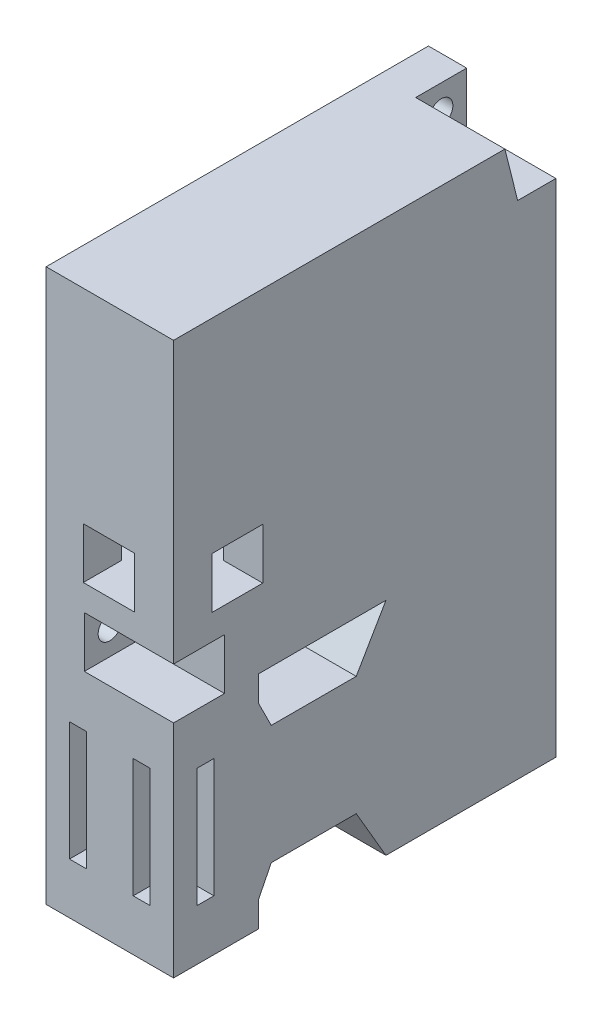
ISO-10303-21;
HEADER;
FILE_DESCRIPTION(('STEP AP214'),'2;1');
FILE_NAME('part.step','',(''),(''),'','','');
FILE_SCHEMA(('AUTOMOTIVE_DESIGN { 1 0 10303 214 1 1 1 1 }'));
ENDSEC;
DATA;
#1=APPLICATION_CONTEXT('core data for automotive mechanical design processes');
#2=APPLICATION_PROTOCOL_DEFINITION('international standard','automotive_design',2000,#1);
#3=PRODUCT_CONTEXT('',#1,'mechanical');
#4=PRODUCT('Part','Part','',(#3));
#5=PRODUCT_RELATED_PRODUCT_CATEGORY('part','',(#4));
#6=PRODUCT_DEFINITION_FORMATION('','',#4);
#7=PRODUCT_DEFINITION_CONTEXT('part definition',#1,'design');
#8=PRODUCT_DEFINITION('design','',#6,#7);
#9=PRODUCT_DEFINITION_SHAPE('','',#8);
#10=(LENGTH_UNIT() NAMED_UNIT(*) SI_UNIT(.MILLI.,.METRE.));
#11=(NAMED_UNIT(*) PLANE_ANGLE_UNIT() SI_UNIT($,.RADIAN.));
#12=(NAMED_UNIT(*) SI_UNIT($,.STERADIAN.) SOLID_ANGLE_UNIT());
#13=UNCERTAINTY_MEASURE_WITH_UNIT(LENGTH_MEASURE(1.E-05),#10,'distance_accuracy_value','');
#14=(GEOMETRIC_REPRESENTATION_CONTEXT(3) GLOBAL_UNCERTAINTY_ASSIGNED_CONTEXT((#13)) GLOBAL_UNIT_ASSIGNED_CONTEXT((#10,
#11,#12)) REPRESENTATION_CONTEXT('',''));
#15=CARTESIAN_POINT('',(0.,0.,0.));
#16=DIRECTION('',(0.,0.,1.));
#17=DIRECTION('',(1.,0.,0.));
#18=AXIS2_PLACEMENT_3D('',#15,#16,#17);
#19=CARTESIAN_POINT('',(0.,0.,-25.));
#20=DIRECTION('',(0.,0.,1.));
#21=DIRECTION('',(1.,0.,0.));
#22=AXIS2_PLACEMENT_3D('',#19,#20,#21);
#23=PLANE('',#22);
#24=DIRECTION('',(1.,0.,0.));
#25=VECTOR('',#24,1.);
#26=CARTESIAN_POINT('',(7.50000000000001,13.9999999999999,-25.));
#27=LINE('',#26,#25);
#28=CARTESIAN_POINT('',(2.,13.9999999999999,-25.));
#29=VERTEX_POINT('',#28);
#30=CARTESIAN_POINT('',(-2.,13.9999999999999,-25.));
#31=VERTEX_POINT('',#30);
#32=EDGE_CURVE('E756',#29,#31,#27,.F.);
#33=ORIENTED_EDGE('',*,*,#32,.T.);
#34=DIRECTION('',(0.,1.,0.));
#35=VECTOR('',#34,1.);
#36=CARTESIAN_POINT('',(-2.,-14.,-25.));
#37=LINE('',#36,#35);
#38=CARTESIAN_POINT('',(-2.,-14.,-25.));
#39=VERTEX_POINT('',#38);
#40=EDGE_CURVE('E652',#31,#39,#37,.F.);
#41=ORIENTED_EDGE('',*,*,#40,.T.);
#42=DIRECTION('',(1.,0.,0.));
#43=VECTOR('',#42,1.);
#44=CARTESIAN_POINT('',(7.50000000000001,-14.0000000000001,-25.));
#45=LINE('',#44,#43);
#46=CARTESIAN_POINT('',(2.,-14.0000000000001,-25.));
#47=VERTEX_POINT('',#46);
#48=EDGE_CURVE('E758',#39,#47,#45,.T.);
#49=ORIENTED_EDGE('',*,*,#48,.T.);
#50=DIRECTION('',(0.,1.,0.));
#51=VECTOR('',#50,1.);
#52=CARTESIAN_POINT('',(2.,13.9999999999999,-25.));
#53=LINE('',#52,#51);
#54=EDGE_CURVE('E634',#47,#29,#53,.T.);
#55=ORIENTED_EDGE('',*,*,#54,.T.);
#56=EDGE_LOOP('',(#33,#41,#49,#55));
#57=FACE_BOUND('',#56,.T.);
#58=ADVANCED_FACE('F15',(#57),#23,.T.);
#59=CARTESIAN_POINT('',(7.50000000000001,-14.0000000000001,-43.));
#60=DIRECTION('',(0.,1.,0.));
#61=DIRECTION('',(0.,0.,1.));
#62=AXIS2_PLACEMENT_3D('',#59,#60,#61);
#63=PLANE('',#62);
#64=DIRECTION('',(0.,0.,1.));
#65=VECTOR('',#64,1.);
#66=CARTESIAN_POINT('',(-13.5,-14.,-50.));
#67=LINE('',#66,#65);
#68=CARTESIAN_POINT('',(-13.5,-14.0000000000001,-25.));
#69=VERTEX_POINT('',#68);
#70=CARTESIAN_POINT('',(-13.5,-14.0000000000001,-43.));
#71=VERTEX_POINT('',#70);
#72=EDGE_CURVE('E669',#69,#71,#67,.F.);
#73=ORIENTED_EDGE('',*,*,#72,.T.);
#74=DIRECTION('',(1.,0.,0.));
#75=VECTOR('',#74,1.);
#76=CARTESIAN_POINT('',(7.5,-14.0000000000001,-43.));
#77=LINE('',#76,#75);
#78=CARTESIAN_POINT('',(7.50000000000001,-14.0000000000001,-43.));
#79=VERTEX_POINT('',#78);
#80=EDGE_CURVE('E746',#71,#79,#77,.T.);
#81=ORIENTED_EDGE('',*,*,#80,.T.);
#82=DIRECTION('',(0.,0.,1.));
#83=VECTOR('',#82,1.);
#84=CARTESIAN_POINT('',(7.50000000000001,-14.0000000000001,-45.));
#85=LINE('',#84,#83);
#86=CARTESIAN_POINT('',(7.50000000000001,-14.0000000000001,-23.));
#87=VERTEX_POINT('',#86);
#88=EDGE_CURVE('E625',#79,#87,#85,.T.);
#89=ORIENTED_EDGE('',*,*,#88,.T.);
#90=DIRECTION('',(1.,0.,0.));
#91=VECTOR('',#90,1.);
#92=CARTESIAN_POINT('',(7.50000000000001,-14.0000000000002,-23.));
#93=LINE('',#92,#91);
#94=CARTESIAN_POINT('',(2.,-14.0000000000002,-23.));
#95=VERTEX_POINT('',#94);
#96=EDGE_CURVE('E644',#87,#95,#93,.F.);
#97=ORIENTED_EDGE('',*,*,#96,.T.);
#98=DIRECTION('',(0.,0.,-1.));
#99=VECTOR('',#98,1.);
#100=CARTESIAN_POINT('',(2.,-14.0000000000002,-25.));
#101=LINE('',#100,#99);
#102=EDGE_CURVE('E636',#95,#47,#101,.T.);
#103=ORIENTED_EDGE('',*,*,#102,.T.);
#104=ORIENTED_EDGE('',*,*,#48,.F.);
#105=DIRECTION('',(0.,0.,1.));
#106=VECTOR('',#105,1.);
#107=CARTESIAN_POINT('',(-2.,-14.,-25.));
#108=LINE('',#107,#106);
#109=CARTESIAN_POINT('',(-2.,-14.0000000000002,-23.));
#110=VERTEX_POINT('',#109);
#111=EDGE_CURVE('E650',#39,#110,#108,.T.);
#112=ORIENTED_EDGE('',*,*,#111,.T.);
#113=DIRECTION('',(1.,0.,0.));
#114=VECTOR('',#113,1.);
#115=CARTESIAN_POINT('',(7.50000000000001,-14.0000000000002,-23.));
#116=LINE('',#115,#114);
#117=CARTESIAN_POINT('',(-13.,-14.0000000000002,-23.));
#118=VERTEX_POINT('',#117);
#119=EDGE_CURVE('E642',#110,#118,#116,.F.);
#120=ORIENTED_EDGE('',*,*,#119,.T.);
#121=DIRECTION('',(0.,0.,-1.));
#122=VECTOR('',#121,1.);
#123=CARTESIAN_POINT('',(-13.,-14.0000000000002,-25.));
#124=LINE('',#123,#122);
#125=CARTESIAN_POINT('',(-13.,-14.0000000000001,-25.));
#126=VERTEX_POINT('',#125);
#127=EDGE_CURVE('E665',#118,#126,#124,.T.);
#128=ORIENTED_EDGE('',*,*,#127,.T.);
#129=DIRECTION('',(-1.,0.,0.));
#130=VECTOR('',#129,1.);
#131=CARTESIAN_POINT('',(-15.,-14.,-25.));
#132=LINE('',#131,#130);
#133=EDGE_CURVE('E673',#126,#69,#132,.T.);
#134=ORIENTED_EDGE('',*,*,#133,.T.);
#135=EDGE_LOOP('',(#73,#81,#89,#97,#103,#104,#112,#120,#128,#134));
#136=FACE_BOUND('',#135,.T.);
#137=ADVANCED_FACE('F1059',(#136),#63,.F.);
#138=CARTESIAN_POINT('',(7.50000000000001,25.9999999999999,-12.));
#139=DIRECTION('',(0.,0.,-1.));
#140=DIRECTION('',(-1.,0.,0.));
#141=AXIS2_PLACEMENT_3D('',#138,#139,#140);
#142=PLANE('',#141);
#143=DIRECTION('',(1.,0.,0.));
#144=VECTOR('',#143,1.);
#145=CARTESIAN_POINT('',(7.50000000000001,25.9999999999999,-12.));
#146=LINE('',#145,#144);
#147=CARTESIAN_POINT('',(-13.5,25.9999999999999,-12.));
#148=VERTEX_POINT('',#147);
#149=CARTESIAN_POINT('',(7.50000000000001,25.9999999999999,-12.));
#150=VERTEX_POINT('',#149);
#151=EDGE_CURVE('E744',#148,#150,#146,.T.);
#152=ORIENTED_EDGE('',*,*,#151,.T.);
#153=DIRECTION('',(0.,1.,0.));
#154=VECTOR('',#153,1.);
#155=CARTESIAN_POINT('',(7.50000000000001,-1.141461E-13,-12.));
#156=LINE('',#155,#154);
#157=CARTESIAN_POINT('',(7.50000000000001,37.9999999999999,-12.));
#158=VERTEX_POINT('',#157);
#159=EDGE_CURVE('E615',#150,#158,#156,.T.);
#160=ORIENTED_EDGE('',*,*,#159,.T.);
#161=DIRECTION('',(1.,0.,0.));
#162=VECTOR('',#161,1.);
#163=CARTESIAN_POINT('',(7.50000000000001,37.9999999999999,-12.));
#164=LINE('',#163,#162);
#165=CARTESIAN_POINT('',(-13.5,37.9999999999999,-12.));
#166=VERTEX_POINT('',#165);
#167=EDGE_CURVE('E742',#158,#166,#164,.F.);
#168=ORIENTED_EDGE('',*,*,#167,.T.);
#169=DIRECTION('',(0.,1.,0.));
#170=VECTOR('',#169,1.);
#171=CARTESIAN_POINT('',(-13.5,31.9999999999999,-12.));
#172=LINE('',#171,#170);
#173=EDGE_CURVE('E731',#148,#166,#172,.T.);
#174=ORIENTED_EDGE('',*,*,#173,.F.);
#175=EDGE_LOOP('',(#152,#160,#168,#174));
#176=FACE_BOUND('',#175,.T.);
#177=ADVANCED_FACE('F1055',(#176),#142,.F.);
#178=CARTESIAN_POINT('',(7.50000000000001,25.9999999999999,-20.));
#179=DIRECTION('',(0.,0.,1.));
#180=DIRECTION('',(1.,0.,0.));
#181=AXIS2_PLACEMENT_3D('',#178,#179,#180);
#182=PLANE('',#181);
#183=DIRECTION('',(1.,0.,0.));
#184=VECTOR('',#183,1.);
#185=CARTESIAN_POINT('',(-22.5,25.9999999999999,-20.));
#186=LINE('',#185,#184);
#187=CARTESIAN_POINT('',(7.50000000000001,25.9999999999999,-20.));
#188=VERTEX_POINT('',#187);
#189=CARTESIAN_POINT('',(-13.5,25.9999999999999,-20.));
#190=VERTEX_POINT('',#189);
#191=EDGE_CURVE('E751',#188,#190,#186,.F.);
#192=ORIENTED_EDGE('',*,*,#191,.F.);
#193=DIRECTION('',(0.,1.,0.));
#194=VECTOR('',#193,1.);
#195=CARTESIAN_POINT('',(7.50000000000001,-1.141461E-13,-20.));
#196=LINE('',#195,#194);
#197=CARTESIAN_POINT('',(7.50000000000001,19.9999999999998,-20.));
#198=VERTEX_POINT('',#197);
#199=EDGE_CURVE('E604',#188,#198,#196,.F.);
#200=ORIENTED_EDGE('',*,*,#199,.T.);
#201=DIRECTION('',(1.,0.,0.));
#202=VECTOR('',#201,1.);
#203=CARTESIAN_POINT('',(7.50000000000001,19.9999999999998,-20.));
#204=LINE('',#203,#202);
#205=CARTESIAN_POINT('',(-13.5,19.9999999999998,-20.));
#206=VERTEX_POINT('',#205);
#207=EDGE_CURVE('E696',#198,#206,#204,.F.);
#208=ORIENTED_EDGE('',*,*,#207,.T.);
#209=DIRECTION('',(0.,1.,0.));
#210=VECTOR('',#209,1.);
#211=CARTESIAN_POINT('',(-13.5,25.9999999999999,-20.));
#212=LINE('',#211,#210);
#213=EDGE_CURVE('E693',#190,#206,#212,.F.);
#214=ORIENTED_EDGE('',*,*,#213,.F.);
#215=EDGE_LOOP('',(#192,#200,#208,#214));
#216=FACE_BOUND('',#215,.T.);
#217=ADVANCED_FACE('F1051',(#216),#182,.F.);
#218=CARTESIAN_POINT('',(7.50000000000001,13.9999999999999,-23.));
#219=DIRECTION('',(0.,-1.,0.));
#220=DIRECTION('',(0.,0.,-1.));
#221=AXIS2_PLACEMENT_3D('',#218,#219,#220);
#222=PLANE('',#221);
#223=DIRECTION('',(0.,0.,-1.));
#224=VECTOR('',#223,1.);
#225=CARTESIAN_POINT('',(-13.,13.9999999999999,-25.));
#226=LINE('',#225,#224);
#227=CARTESIAN_POINT('',(-13.,13.9999999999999,-25.));
#228=VERTEX_POINT('',#227);
#229=CARTESIAN_POINT('',(-13.,13.9999999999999,-23.));
#230=VERTEX_POINT('',#229);
#231=EDGE_CURVE('E659',#228,#230,#226,.F.);
#232=ORIENTED_EDGE('',*,*,#231,.T.);
#233=DIRECTION('',(1.,0.,0.));
#234=VECTOR('',#233,1.);
#235=CARTESIAN_POINT('',(7.50000000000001,13.9999999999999,-23.));
#236=LINE('',#235,#234);
#237=CARTESIAN_POINT('',(-2.,13.9999999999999,-23.));
#238=VERTEX_POINT('',#237);
#239=EDGE_CURVE('E700',#230,#238,#236,.T.);
#240=ORIENTED_EDGE('',*,*,#239,.T.);
#241=DIRECTION('',(0.,0.,1.));
#242=VECTOR('',#241,1.);
#243=CARTESIAN_POINT('',(-2.,13.9999999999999,-25.));
#244=LINE('',#243,#242);
#245=EDGE_CURVE('E654',#238,#31,#244,.F.);
#246=ORIENTED_EDGE('',*,*,#245,.T.);
#247=ORIENTED_EDGE('',*,*,#32,.F.);
#248=DIRECTION('',(0.,0.,-1.));
#249=VECTOR('',#248,1.);
#250=CARTESIAN_POINT('',(2.,13.9999999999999,-25.));
#251=LINE('',#250,#249);
#252=CARTESIAN_POINT('',(2.,13.9999999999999,-23.));
#253=VERTEX_POINT('',#252);
#254=EDGE_CURVE('E632',#29,#253,#251,.F.);
#255=ORIENTED_EDGE('',*,*,#254,.T.);
#256=DIRECTION('',(1.,0.,0.));
#257=VECTOR('',#256,1.);
#258=CARTESIAN_POINT('',(7.50000000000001,13.9999999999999,-23.));
#259=LINE('',#258,#257);
#260=CARTESIAN_POINT('',(7.50000000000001,13.9999999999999,-23.));
#261=VERTEX_POINT('',#260);
#262=EDGE_CURVE('E698',#253,#261,#259,.T.);
#263=ORIENTED_EDGE('',*,*,#262,.T.);
#264=DIRECTION('',(0.,0.,1.));
#265=VECTOR('',#264,1.);
#266=CARTESIAN_POINT('',(7.50000000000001,13.9999999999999,-45.));
#267=LINE('',#266,#265);
#268=CARTESIAN_POINT('',(7.50000000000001,13.9999999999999,-43.));
#269=VERTEX_POINT('',#268);
#270=EDGE_CURVE('E599',#261,#269,#267,.F.);
#271=ORIENTED_EDGE('',*,*,#270,.T.);
#272=DIRECTION('',(1.,0.,0.));
#273=VECTOR('',#272,1.);
#274=CARTESIAN_POINT('',(7.50000000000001,13.9999999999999,-43.));
#275=LINE('',#274,#273);
#276=CARTESIAN_POINT('',(-13.5,13.9999999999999,-43.));
#277=VERTEX_POINT('',#276);
#278=EDGE_CURVE('E754',#269,#277,#275,.F.);
#279=ORIENTED_EDGE('',*,*,#278,.T.);
#280=DIRECTION('',(0.,0.,-1.));
#281=VECTOR('',#280,1.);
#282=CARTESIAN_POINT('',(-13.5,13.9999999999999,-20.));
#283=LINE('',#282,#281);
#284=CARTESIAN_POINT('',(-13.5,13.9999999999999,-25.));
#285=VERTEX_POINT('',#284);
#286=EDGE_CURVE('E687',#285,#277,#283,.T.);
#287=ORIENTED_EDGE('',*,*,#286,.F.);
#288=DIRECTION('',(-1.,0.,0.));
#289=VECTOR('',#288,1.);
#290=CARTESIAN_POINT('',(-15.,13.9999999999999,-25.));
#291=LINE('',#290,#289);
#292=EDGE_CURVE('E675',#285,#228,#291,.F.);
#293=ORIENTED_EDGE('',*,*,#292,.T.);
#294=EDGE_LOOP('',(#232,#240,#246,#247,#255,#263,#271,#279,#287,#293));
#295=FACE_BOUND('',#294,.T.);
#296=ADVANCED_FACE('F1047',(#295),#222,.F.);
#297=CARTESIAN_POINT('',(7.50000000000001,13.9999999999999,-43.));
#298=DIRECTION('',(0.,-0.503871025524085,-0.863778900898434));
#299=DIRECTION('',(0.,0.863778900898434,-0.503871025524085));
#300=AXIS2_PLACEMENT_3D('',#297,#298,#299);
#301=PLANE('',#300);
#302=ORIENTED_EDGE('',*,*,#278,.F.);
#303=DIRECTION('',(0.,0.863778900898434,-0.503871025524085));
#304=VECTOR('',#303,1.);
#305=CARTESIAN_POINT('',(7.50000000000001,13.9999999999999,-43.));
#306=LINE('',#305,#304);
#307=CARTESIAN_POINT('',(7.50000000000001,25.9999999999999,-50.));
#308=VERTEX_POINT('',#307);
#309=EDGE_CURVE('E597',#269,#308,#306,.T.);
#310=ORIENTED_EDGE('',*,*,#309,.T.);
#311=DIRECTION('',(1.,0.,0.));
#312=VECTOR('',#311,1.);
#313=CARTESIAN_POINT('',(-22.5,25.9999999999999,-50.));
#314=LINE('',#313,#312);
#315=CARTESIAN_POINT('',(-13.5,25.9999999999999,-50.));
#316=VERTEX_POINT('',#315);
#317=EDGE_CURVE('E748',#316,#308,#314,.T.);
#318=ORIENTED_EDGE('',*,*,#317,.F.);
#319=DIRECTION('',(0.,0.863778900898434,-0.503871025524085));
#320=VECTOR('',#319,1.);
#321=CARTESIAN_POINT('',(-13.5,13.9999999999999,-43.));
#322=LINE('',#321,#320);
#323=EDGE_CURVE('E684',#277,#316,#322,.T.);
#324=ORIENTED_EDGE('',*,*,#323,.F.);
#325=EDGE_LOOP('',(#302,#310,#318,#324));
#326=FACE_BOUND('',#325,.T.);
#327=ADVANCED_FACE('F1043',(#326),#301,.F.);
#328=CARTESIAN_POINT('',(-22.5,25.9999999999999,-90.));
#329=DIRECTION('',(0.,-1.,0.));
#330=DIRECTION('',(0.,0.,-1.));
#331=AXIS2_PLACEMENT_3D('',#328,#329,#330);
#332=PLANE('',#331);
#333=ORIENTED_EDGE('',*,*,#317,.T.);
#334=DIRECTION('',(0.,0.,1.));
#335=VECTOR('',#334,1.);
#336=CARTESIAN_POINT('',(7.50000000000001,25.9999999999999,-45.));
#337=LINE('',#336,#335);
#338=EDGE_CURVE('E594',#308,#188,#337,.T.);
#339=ORIENTED_EDGE('',*,*,#338,.T.);
#340=ORIENTED_EDGE('',*,*,#191,.T.);
#341=DIRECTION('',(0.,0.,-1.));
#342=VECTOR('',#341,1.);
#343=CARTESIAN_POINT('',(-13.5,25.9999999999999,-20.));
#344=LINE('',#343,#342);
#345=EDGE_CURVE('E681',#316,#190,#344,.F.);
#346=ORIENTED_EDGE('',*,*,#345,.F.);
#347=EDGE_LOOP('',(#333,#339,#340,#346));
#348=FACE_BOUND('',#347,.T.);
#349=ADVANCED_FACE('F1039',(#348),#332,.T.);
#350=CARTESIAN_POINT('',(7.50000000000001,91.9999999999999,-81.));
#351=DIRECTION('',(0.,-1.,0.));
#352=DIRECTION('',(0.,0.,-1.));
#353=AXIS2_PLACEMENT_3D('',#350,#351,#352);
#354=PLANE('',#353);
#355=DIRECTION('',(1.,0.,0.));
#356=VECTOR('',#355,1.);
#357=CARTESIAN_POINT('',(7.50000000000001,91.9999999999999,-81.));
#358=LINE('',#357,#356);
#359=CARTESIAN_POINT('',(-13.5,91.9999999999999,-81.));
#360=VERTEX_POINT('',#359);
#361=CARTESIAN_POINT('',(7.50000000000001,91.9999999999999,-81.));
#362=VERTEX_POINT('',#361);
#363=EDGE_CURVE('E740',#360,#362,#358,.T.);
#364=ORIENTED_EDGE('',*,*,#363,.T.);
#365=DIRECTION('',(0.,0.,1.));
#366=VECTOR('',#365,1.);
#367=CARTESIAN_POINT('',(7.50000000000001,91.9999999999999,-45.));
#368=LINE('',#367,#366);
#369=CARTESIAN_POINT('',(7.50000000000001,91.9999999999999,-90.));
#370=VERTEX_POINT('',#369);
#371=EDGE_CURVE('E608',#362,#370,#368,.F.);
#372=ORIENTED_EDGE('',*,*,#371,.T.);
#373=DIRECTION('',(-1.,0.,0.));
#374=VECTOR('',#373,1.);
#375=CARTESIAN_POINT('',(7.5,91.9999999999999,-90.));
#376=LINE('',#375,#374);
#377=CARTESIAN_POINT('',(-13.5,91.9999999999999,-90.));
#378=VERTEX_POINT('',#377);
#379=EDGE_CURVE('E581',#378,#370,#376,.F.);
#380=ORIENTED_EDGE('',*,*,#379,.F.);
#381=DIRECTION('',(0.,0.,-1.));
#382=VECTOR('',#381,1.);
#383=CARTESIAN_POINT('',(-13.5,91.9999999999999,-84.6576707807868));
#384=LINE('',#383,#382);
#385=EDGE_CURVE('E734',#360,#378,#384,.T.);
#386=ORIENTED_EDGE('',*,*,#385,.F.);
#387=EDGE_LOOP('',(#364,#372,#380,#386));
#388=FACE_BOUND('',#387,.T.);
#389=ADVANCED_FACE('F1035',(#388),#354,.F.);
#390=CARTESIAN_POINT('',(7.5,-26.0000000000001,-50.));
#391=DIRECTION('',(0.,0.503871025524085,-0.863778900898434));
#392=DIRECTION('',(0.,0.863778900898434,0.503871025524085));
#393=AXIS2_PLACEMENT_3D('',#390,#391,#392);
#394=PLANE('',#393);
#395=DIRECTION('',(1.,0.,0.));
#396=VECTOR('',#395,1.);
#397=CARTESIAN_POINT('',(7.5,-26.0000000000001,-50.));
#398=LINE('',#397,#396);
#399=CARTESIAN_POINT('',(7.5,-26.0000000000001,-50.));
#400=VERTEX_POINT('',#399);
#401=CARTESIAN_POINT('',(-13.5,-26.0000000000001,-50.));
#402=VERTEX_POINT('',#401);
#403=EDGE_CURVE('E573',#400,#402,#398,.F.);
#404=ORIENTED_EDGE('',*,*,#403,.F.);
#405=DIRECTION('',(0.,0.863778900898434,0.503871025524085));
#406=VECTOR('',#405,1.);
#407=CARTESIAN_POINT('',(7.50000000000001,-26.0000000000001,-50.));
#408=LINE('',#407,#406);
#409=EDGE_CURVE('E627',#400,#79,#408,.T.);
#410=ORIENTED_EDGE('',*,*,#409,.T.);
#411=ORIENTED_EDGE('',*,*,#80,.F.);
#412=DIRECTION('',(0.,-0.863778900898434,-0.503871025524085));
#413=VECTOR('',#412,1.);
#414=CARTESIAN_POINT('',(-13.5,-14.0000000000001,-43.));
#415=LINE('',#414,#413);
#416=EDGE_CURVE('E667',#71,#402,#415,.T.);
#417=ORIENTED_EDGE('',*,*,#416,.T.);
#418=EDGE_LOOP('',(#404,#410,#411,#417));
#419=FACE_BOUND('',#418,.T.);
#420=ADVANCED_FACE('F1031',(#419),#394,.F.);
#421=CARTESIAN_POINT('',(7.50000000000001,-20.,-20.));
#422=DIRECTION('',(0.,0.,1.));
#423=DIRECTION('',(1.,0.,0.));
#424=AXIS2_PLACEMENT_3D('',#421,#422,#423);
#425=PLANE('',#424);
#426=DIRECTION('',(1.,0.,0.));
#427=VECTOR('',#426,1.);
#428=CARTESIAN_POINT('',(7.50000000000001,-20.,-20.));
#429=LINE('',#428,#427);
#430=CARTESIAN_POINT('',(-13.5,-20.,-20.));
#431=VERTEX_POINT('',#430);
#432=CARTESIAN_POINT('',(7.5,-20.,-20.));
#433=VERTEX_POINT('',#432);
#434=EDGE_CURVE('E646',#431,#433,#429,.T.);
#435=ORIENTED_EDGE('',*,*,#434,.T.);
#436=DIRECTION('',(0.,1.,0.));
#437=VECTOR('',#436,1.);
#438=CARTESIAN_POINT('',(7.50000000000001,-1.141461E-13,-20.));
#439=LINE('',#438,#437);
#440=CARTESIAN_POINT('',(7.5,-26.0000000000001,-20.));
#441=VERTEX_POINT('',#440);
#442=EDGE_CURVE('E620',#433,#441,#439,.F.);
#443=ORIENTED_EDGE('',*,*,#442,.T.);
#444=DIRECTION('',(1.,0.,0.));
#445=VECTOR('',#444,1.);
#446=CARTESIAN_POINT('',(7.5,-26.0000000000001,-20.));
#447=LINE('',#446,#445);
#448=CARTESIAN_POINT('',(-13.5,-26.0000000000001,-20.));
#449=VERTEX_POINT('',#448);
#450=EDGE_CURVE('E567',#449,#441,#447,.T.);
#451=ORIENTED_EDGE('',*,*,#450,.F.);
#452=DIRECTION('',(0.,1.,0.));
#453=VECTOR('',#452,1.);
#454=CARTESIAN_POINT('',(-13.5,-26.0000000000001,-20.));
#455=LINE('',#454,#453);
#456=EDGE_CURVE('E671',#449,#431,#455,.T.);
#457=ORIENTED_EDGE('',*,*,#456,.T.);
#458=EDGE_LOOP('',(#435,#443,#451,#457));
#459=FACE_BOUND('',#458,.T.);
#460=ADVANCED_FACE('F1027',(#459),#425,.F.);
#461=CARTESIAN_POINT('',(7.50000000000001,25.9999999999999,0.));
#462=DIRECTION('',(0.,-1.,0.));
#463=DIRECTION('',(0.,0.,-1.));
#464=AXIS2_PLACEMENT_3D('',#461,#462,#463);
#465=PLANE('',#464);
#466=DIRECTION('',(1.,0.,0.));
#467=VECTOR('',#466,1.);
#468=CARTESIAN_POINT('',(7.50000000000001,25.9999999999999,0.));
#469=LINE('',#468,#467);
#470=CARTESIAN_POINT('',(7.50000000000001,25.9999999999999,0.));
#471=VERTEX_POINT('',#470);
#472=CARTESIAN_POINT('',(-13.5,25.9999999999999,0.));
#473=VERTEX_POINT('',#472);
#474=EDGE_CURVE('E556',#471,#473,#469,.F.);
#475=ORIENTED_EDGE('',*,*,#474,.F.);
#476=DIRECTION('',(0.,0.,1.));
#477=VECTOR('',#476,1.);
#478=CARTESIAN_POINT('',(7.50000000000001,25.9999999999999,-45.));
#479=LINE('',#478,#477);
#480=EDGE_CURVE('E617',#471,#150,#479,.F.);
#481=ORIENTED_EDGE('',*,*,#480,.T.);
#482=ORIENTED_EDGE('',*,*,#151,.F.);
#483=DIRECTION('',(0.,0.,-1.));
#484=VECTOR('',#483,1.);
#485=CARTESIAN_POINT('',(-13.5,25.9999999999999,-6.));
#486=LINE('',#485,#484);
#487=EDGE_CURVE('E726',#473,#148,#486,.T.);
#488=ORIENTED_EDGE('',*,*,#487,.F.);
#489=EDGE_LOOP('',(#475,#481,#482,#488));
#490=FACE_BOUND('',#489,.T.);
#491=ADVANCED_FACE('F1023',(#490),#465,.F.);
#492=CARTESIAN_POINT('',(7.50000000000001,37.9999999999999,-12.));
#493=DIRECTION('',(0.,1.,0.));
#494=DIRECTION('',(0.,0.,1.));
#495=AXIS2_PLACEMENT_3D('',#492,#493,#494);
#496=PLANE('',#495);
#497=ORIENTED_EDGE('',*,*,#167,.F.);
#498=DIRECTION('',(0.,0.,1.));
#499=VECTOR('',#498,1.);
#500=CARTESIAN_POINT('',(7.50000000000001,37.9999999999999,-45.));
#501=LINE('',#500,#499);
#502=CARTESIAN_POINT('',(7.50000000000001,37.9999999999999,0.));
#503=VERTEX_POINT('',#502);
#504=EDGE_CURVE('E613',#158,#503,#501,.T.);
#505=ORIENTED_EDGE('',*,*,#504,.T.);
#506=DIRECTION('',(1.,0.,0.));
#507=VECTOR('',#506,1.);
#508=CARTESIAN_POINT('',(7.50000000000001,37.9999999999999,0.));
#509=LINE('',#508,#507);
#510=CARTESIAN_POINT('',(-13.5,37.9999999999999,0.));
#511=VERTEX_POINT('',#510);
#512=EDGE_CURVE('E550',#511,#503,#509,.T.);
#513=ORIENTED_EDGE('',*,*,#512,.F.);
#514=DIRECTION('',(0.,0.,-1.));
#515=VECTOR('',#514,1.);
#516=CARTESIAN_POINT('',(-13.5,37.9999999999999,-6.));
#517=LINE('',#516,#515);
#518=EDGE_CURVE('E729',#166,#511,#517,.F.);
#519=ORIENTED_EDGE('',*,*,#518,.F.);
#520=EDGE_LOOP('',(#497,#505,#513,#519));
#521=FACE_BOUND('',#520,.T.);
#522=ADVANCED_FACE('F1019',(#521),#496,.F.);
#523=CARTESIAN_POINT('',(7.50000000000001,104.,-78.));
#524=DIRECTION('',(0.,-0.242535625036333,0.970142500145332));
#525=DIRECTION('',(0.,-0.970142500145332,-0.242535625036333));
#526=AXIS2_PLACEMENT_3D('',#523,#524,#525);
#527=PLANE('',#526);
#528=DIRECTION('',(1.,0.,0.));
#529=VECTOR('',#528,1.);
#530=CARTESIAN_POINT('',(-22.5,104.,-78.));
#531=LINE('',#530,#529);
#532=CARTESIAN_POINT('',(7.50000000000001,104.,-78.));
#533=VERTEX_POINT('',#532);
#534=CARTESIAN_POINT('',(-13.5,104.,-78.));
#535=VERTEX_POINT('',#534);
#536=EDGE_CURVE('E521',#533,#535,#531,.F.);
#537=ORIENTED_EDGE('',*,*,#536,.F.);
#538=DIRECTION('',(0.,-0.970142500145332,-0.242535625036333));
#539=VECTOR('',#538,1.);
#540=CARTESIAN_POINT('',(7.50000000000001,104.,-78.));
#541=LINE('',#540,#539);
#542=EDGE_CURVE('E610',#533,#362,#541,.T.);
#543=ORIENTED_EDGE('',*,*,#542,.T.);
#544=ORIENTED_EDGE('',*,*,#363,.F.);
#545=DIRECTION('',(0.,-0.970142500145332,-0.242535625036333));
#546=VECTOR('',#545,1.);
#547=CARTESIAN_POINT('',(-13.5,104.,-78.));
#548=LINE('',#547,#546);
#549=EDGE_CURVE('E737',#535,#360,#548,.T.);
#550=ORIENTED_EDGE('',*,*,#549,.F.);
#551=EDGE_LOOP('',(#537,#543,#544,#550));
#552=FACE_BOUND('',#551,.T.);
#553=ADVANCED_FACE('F1016',(#552),#527,.F.);
#554=CARTESIAN_POINT('',(-13.5,98.3967439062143,-84.6576707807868));
#555=DIRECTION('',(1.,0.,0.));
#556=DIRECTION('',(0.,0.,-1.));
#557=AXIS2_PLACEMENT_3D('',#554,#555,#556);
#558=PLANE('',#557);
#559=CARTESIAN_POINT('',(-13.5,97.9999999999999,-84.));
#560=DIRECTION('',(-1.,0.,0.));
#561=DIRECTION('',(0.,0.,1.));
#562=AXIS2_PLACEMENT_3D('',#559,#560,#561);
#563=CIRCLE('',#562,2.75);
#564=CARTESIAN_POINT('',(-13.5,97.9999999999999,-81.25));
#565=VERTEX_POINT('',#564);
#566=EDGE_CURVE('E19',#565,#565,#563,.T.);
#567=ORIENTED_EDGE('',*,*,#566,.T.);
#568=EDGE_LOOP('',(#567));
#569=FACE_BOUND('',#568,.T.);
#570=DIRECTION('',(0.,1.,0.));
#571=VECTOR('',#570,1.);
#572=CARTESIAN_POINT('',(-13.5,-26.0000000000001,-90.));
#573=LINE('',#572,#571);
#574=CARTESIAN_POINT('',(-13.5,104.,-90.));
#575=VERTEX_POINT('',#574);
#576=EDGE_CURVE('E576',#575,#378,#573,.F.);
#577=ORIENTED_EDGE('',*,*,#576,.F.);
#578=DIRECTION('',(0.,0.,1.));
#579=VECTOR('',#578,1.);
#580=CARTESIAN_POINT('',(-13.5,104.,0.));
#581=LINE('',#580,#579);
#582=EDGE_CURVE('E518',#535,#575,#581,.F.);
#583=ORIENTED_EDGE('',*,*,#582,.F.);
#584=ORIENTED_EDGE('',*,*,#549,.T.);
#585=ORIENTED_EDGE('',*,*,#385,.T.);
#586=EDGE_LOOP('',(#577,#583,#584,#585));
#587=FACE_BOUND('',#586,.T.);
#588=ADVANCED_FACE('F807',(#569,#587),#558,.T.);
#589=CARTESIAN_POINT('',(-13.5,31.9999999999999,-6.));
#590=DIRECTION('',(1.,0.,0.));
#591=DIRECTION('',(0.,0.,-1.));
#592=AXIS2_PLACEMENT_3D('',#589,#590,#591);
#593=PLANE('',#592);
#594=CARTESIAN_POINT('',(-13.5,31.9999999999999,-6.));
#595=DIRECTION('',(-1.,0.,0.));
#596=DIRECTION('',(0.,-1.,0.));
#597=AXIS2_PLACEMENT_3D('',#594,#595,#596);
#598=CIRCLE('',#597,2.75);
#599=CARTESIAN_POINT('',(-13.5,29.2499999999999,-6.));
#600=VERTEX_POINT('',#599);
#601=EDGE_CURVE('E508',#600,#600,#598,.T.);
#602=ORIENTED_EDGE('',*,*,#601,.T.);
#603=EDGE_LOOP('',(#602));
#604=FACE_BOUND('',#603,.T.);
#605=DIRECTION('',(0.,1.,0.));
#606=VECTOR('',#605,1.);
#607=CARTESIAN_POINT('',(-13.5,25.9999999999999,0.));
#608=LINE('',#607,#606);
#609=EDGE_CURVE('E553',#473,#511,#608,.T.);
#610=ORIENTED_EDGE('',*,*,#609,.F.);
#611=ORIENTED_EDGE('',*,*,#487,.T.);
#612=ORIENTED_EDGE('',*,*,#173,.T.);
#613=ORIENTED_EDGE('',*,*,#518,.T.);
#614=EDGE_LOOP('',(#610,#611,#612,#613));
#615=FACE_BOUND('',#614,.T.);
#616=ADVANCED_FACE('F1010',(#604,#615),#593,.T.);
#617=CARTESIAN_POINT('',(-13.75,55.9999999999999,0.));
#618=DIRECTION('',(-1.,0.,0.));
#619=DIRECTION('',(0.,0.,1.));
#620=AXIS2_PLACEMENT_3D('',#617,#618,#619);
#621=PLANE('',#620);
#622=DIRECTION('',(0.,0.,1.));
#623=VECTOR('',#622,1.);
#624=CARTESIAN_POINT('',(-13.75,55.9999999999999,0.));
#625=LINE('',#624,#623);
#626=CARTESIAN_POINT('',(-13.75,55.9999999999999,-9.));
#627=VERTEX_POINT('',#626);
#628=CARTESIAN_POINT('',(-13.75,55.9999999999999,0.));
#629=VERTEX_POINT('',#628);
#630=EDGE_CURVE('E468',#627,#629,#625,.T.);
#631=ORIENTED_EDGE('',*,*,#630,.T.);
#632=DIRECTION('',(0.,1.,0.));
#633=VECTOR('',#632,1.);
#634=CARTESIAN_POINT('',(-13.75,25.9999999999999,0.));
#635=LINE('',#634,#633);
#636=CARTESIAN_POINT('',(-13.75,44.,0.));
#637=VERTEX_POINT('',#636);
#638=EDGE_CURVE('E527',#637,#629,#635,.T.);
#639=ORIENTED_EDGE('',*,*,#638,.F.);
#640=DIRECTION('',(0.,0.,-1.));
#641=VECTOR('',#640,1.);
#642=CARTESIAN_POINT('',(-13.75,44.,0.));
#643=LINE('',#642,#641);
#644=CARTESIAN_POINT('',(-13.75,44.,-9.));
#645=VERTEX_POINT('',#644);
#646=EDGE_CURVE('E491',#637,#645,#643,.T.);
#647=ORIENTED_EDGE('',*,*,#646,.T.);
#648=DIRECTION('',(0.,1.,0.));
#649=VECTOR('',#648,1.);
#650=CARTESIAN_POINT('',(-13.75,55.9999999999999,-9.));
#651=LINE('',#650,#649);
#652=EDGE_CURVE('E506',#645,#627,#651,.T.);
#653=ORIENTED_EDGE('',*,*,#652,.T.);
#654=EDGE_LOOP('',(#631,#639,#647,#653));
#655=FACE_BOUND('',#654,.T.);
#656=ADVANCED_FACE('F1006',(#655),#621,.F.);
#657=CARTESIAN_POINT('',(-1.74999999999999,44.,0.));
#658=DIRECTION('',(1.,0.,0.));
#659=DIRECTION('',(0.,0.,-1.));
#660=AXIS2_PLACEMENT_3D('',#657,#658,#659);
#661=PLANE('',#660);
#662=DIRECTION('',(0.,0.,-1.));
#663=VECTOR('',#662,1.);
#664=CARTESIAN_POINT('',(-1.74999999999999,44.,0.));
#665=LINE('',#664,#663);
#666=CARTESIAN_POINT('',(-1.74999999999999,44.,-9.00000000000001));
#667=VERTEX_POINT('',#666);
#668=CARTESIAN_POINT('',(-1.74999999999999,44.,0.));
#669=VERTEX_POINT('',#668);
#670=EDGE_CURVE('E496',#667,#669,#665,.F.);
#671=ORIENTED_EDGE('',*,*,#670,.T.);
#672=DIRECTION('',(0.,1.,0.));
#673=VECTOR('',#672,1.);
#674=CARTESIAN_POINT('',(-1.74999999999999,25.9999999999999,0.));
#675=LINE('',#674,#673);
#676=CARTESIAN_POINT('',(-1.74999999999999,55.9999999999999,0.));
#677=VERTEX_POINT('',#676);
#678=EDGE_CURVE('E524',#677,#669,#675,.F.);
#679=ORIENTED_EDGE('',*,*,#678,.F.);
#680=DIRECTION('',(0.,0.,1.));
#681=VECTOR('',#680,1.);
#682=CARTESIAN_POINT('',(-1.74999999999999,55.9999999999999,0.));
#683=LINE('',#682,#681);
#684=CARTESIAN_POINT('',(-1.74999999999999,55.9999999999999,-9.00000000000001));
#685=VERTEX_POINT('',#684);
#686=EDGE_CURVE('E463',#677,#685,#683,.F.);
#687=ORIENTED_EDGE('',*,*,#686,.T.);
#688=DIRECTION('',(0.,1.,0.));
#689=VECTOR('',#688,1.);
#690=CARTESIAN_POINT('',(-1.74999999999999,55.9999999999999,-9.));
#691=LINE('',#690,#689);
#692=EDGE_CURVE('E724',#685,#667,#691,.F.);
#693=ORIENTED_EDGE('',*,*,#692,.T.);
#694=EDGE_LOOP('',(#671,#679,#687,#693));
#695=FACE_BOUND('',#694,.T.);
#696=ADVANCED_FACE('F1002',(#695),#661,.F.);
#697=CARTESIAN_POINT('',(7.50000000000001,55.9999999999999,-9.));
#698=DIRECTION('',(0.,0.,1.));
#699=DIRECTION('',(1.,0.,0.));
#700=AXIS2_PLACEMENT_3D('',#697,#698,#699);
#701=PLANE('',#700);
#702=DIRECTION('',(1.,0.,0.));
#703=VECTOR('',#702,1.);
#704=CARTESIAN_POINT('',(-1.74999999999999,55.9999999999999,-9.));
#705=LINE('',#704,#703);
#706=CARTESIAN_POINT('',(7.50000000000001,55.9999999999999,-9.));
#707=VERTEX_POINT('',#706);
#708=EDGE_CURVE('E461',#685,#707,#705,.T.);
#709=ORIENTED_EDGE('',*,*,#708,.T.);
#710=DIRECTION('',(0.,1.,0.));
#711=VECTOR('',#710,1.);
#712=CARTESIAN_POINT('',(7.50000000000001,-1.141461E-13,-9.));
#713=LINE('',#712,#711);
#714=CARTESIAN_POINT('',(7.50000000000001,44.,-9.));
#715=VERTEX_POINT('',#714);
#716=EDGE_CURVE('E590',#707,#715,#713,.F.);
#717=ORIENTED_EDGE('',*,*,#716,.T.);
#718=DIRECTION('',(1.,0.,0.));
#719=VECTOR('',#718,1.);
#720=CARTESIAN_POINT('',(-13.75,44.,-9.00000000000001));
#721=LINE('',#720,#719);
#722=EDGE_CURVE('E498',#715,#667,#721,.F.);
#723=ORIENTED_EDGE('',*,*,#722,.T.);
#724=ORIENTED_EDGE('',*,*,#692,.F.);
#725=EDGE_LOOP('',(#709,#717,#723,#724));
#726=FACE_BOUND('',#725,.T.);
#727=ADVANCED_FACE('F998',(#726),#701,.F.);
#728=CARTESIAN_POINT('',(7.50000000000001,44.,-21.));
#729=DIRECTION('',(0.,0.,-1.));
#730=DIRECTION('',(-1.,0.,0.));
#731=AXIS2_PLACEMENT_3D('',#728,#729,#730);
#732=PLANE('',#731);
#733=DIRECTION('',(1.,0.,0.));
#734=VECTOR('',#733,1.);
#735=CARTESIAN_POINT('',(-13.75,44.,-21.));
#736=LINE('',#735,#734);
#737=CARTESIAN_POINT('',(-1.74999999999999,44.,-21.));
#738=VERTEX_POINT('',#737);
#739=CARTESIAN_POINT('',(7.50000000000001,44.,-21.));
#740=VERTEX_POINT('',#739);
#741=EDGE_CURVE('E504',#738,#740,#736,.T.);
#742=ORIENTED_EDGE('',*,*,#741,.T.);
#743=DIRECTION('',(0.,1.,0.));
#744=VECTOR('',#743,1.);
#745=CARTESIAN_POINT('',(7.50000000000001,-1.141461E-13,-21.));
#746=LINE('',#745,#744);
#747=CARTESIAN_POINT('',(7.50000000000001,55.9999999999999,-21.));
#748=VERTEX_POINT('',#747);
#749=EDGE_CURVE('E592',#740,#748,#746,.T.);
#750=ORIENTED_EDGE('',*,*,#749,.T.);
#751=DIRECTION('',(1.,0.,0.));
#752=VECTOR('',#751,1.);
#753=CARTESIAN_POINT('',(-1.74999999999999,55.9999999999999,-21.));
#754=LINE('',#753,#752);
#755=CARTESIAN_POINT('',(-1.74999999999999,55.9999999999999,-21.));
#756=VERTEX_POINT('',#755);
#757=EDGE_CURVE('E456',#748,#756,#754,.F.);
#758=ORIENTED_EDGE('',*,*,#757,.T.);
#759=DIRECTION('',(0.,1.,0.));
#760=VECTOR('',#759,1.);
#761=CARTESIAN_POINT('',(-1.74999999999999,44.,-21.));
#762=LINE('',#761,#760);
#763=EDGE_CURVE('E722',#756,#738,#762,.F.);
#764=ORIENTED_EDGE('',*,*,#763,.T.);
#765=EDGE_LOOP('',(#742,#750,#758,#764));
#766=FACE_BOUND('',#765,.T.);
#767=ADVANCED_FACE('F994',(#766),#732,.F.);
#768=CARTESIAN_POINT('',(-1.74999999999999,44.,0.));
#769=DIRECTION('',(1.,0.,0.));
#770=DIRECTION('',(0.,0.,-1.));
#771=AXIS2_PLACEMENT_3D('',#768,#769,#770);
#772=PLANE('',#771);
#773=DIRECTION('',(0.,0.,1.));
#774=VECTOR('',#773,1.);
#775=CARTESIAN_POINT('',(-1.74999999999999,55.9999999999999,0.));
#776=LINE('',#775,#774);
#777=CARTESIAN_POINT('',(-1.74999999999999,55.9999999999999,-25.8));
#778=VERTEX_POINT('',#777);
#779=EDGE_CURVE('E454',#756,#778,#776,.F.);
#780=ORIENTED_EDGE('',*,*,#779,.T.);
#781=DIRECTION('',(0.,1.,0.));
#782=VECTOR('',#781,1.);
#783=CARTESIAN_POINT('',(-1.74999999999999,50.,-25.8));
#784=LINE('',#783,#782);
#785=CARTESIAN_POINT('',(-1.74999999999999,44.,-25.8));
#786=VERTEX_POINT('',#785);
#787=EDGE_CURVE('E719',#786,#778,#784,.T.);
#788=ORIENTED_EDGE('',*,*,#787,.F.);
#789=DIRECTION('',(0.,0.,-1.));
#790=VECTOR('',#789,1.);
#791=CARTESIAN_POINT('',(-1.74999999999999,44.,0.));
#792=LINE('',#791,#790);
#793=EDGE_CURVE('E480',#786,#738,#792,.F.);
#794=ORIENTED_EDGE('',*,*,#793,.T.);
#795=ORIENTED_EDGE('',*,*,#763,.F.);
#796=EDGE_LOOP('',(#780,#788,#794,#795));
#797=FACE_BOUND('',#796,.T.);
#798=ADVANCED_FACE('F990',(#797),#772,.F.);
#799=CARTESIAN_POINT('',(-7.75,50.,-25.8));
#800=DIRECTION('',(0.,0.,1.));
#801=DIRECTION('',(1.,0.,0.));
#802=AXIS2_PLACEMENT_3D('',#799,#800,#801);
#803=PLANE('',#802);
#804=ORIENTED_EDGE('',*,*,#787,.T.);
#805=DIRECTION('',(1.,0.,0.));
#806=VECTOR('',#805,1.);
#807=CARTESIAN_POINT('',(-1.74999999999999,55.9999999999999,-25.8));
#808=LINE('',#807,#806);
#809=CARTESIAN_POINT('',(-13.75,55.9999999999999,-25.8));
#810=VERTEX_POINT('',#809);
#811=EDGE_CURVE('E452',#778,#810,#808,.F.);
#812=ORIENTED_EDGE('',*,*,#811,.T.);
#813=DIRECTION('',(0.,1.,0.));
#814=VECTOR('',#813,1.);
#815=CARTESIAN_POINT('',(-13.75,55.9999999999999,-25.8));
#816=LINE('',#815,#814);
#817=CARTESIAN_POINT('',(-13.75,44.,-25.8));
#818=VERTEX_POINT('',#817);
#819=EDGE_CURVE('E704',#810,#818,#816,.F.);
#820=ORIENTED_EDGE('',*,*,#819,.T.);
#821=DIRECTION('',(1.,0.,0.));
#822=VECTOR('',#821,1.);
#823=CARTESIAN_POINT('',(-13.75,44.,-25.8));
#824=LINE('',#823,#822);
#825=EDGE_CURVE('E483',#818,#786,#824,.T.);
#826=ORIENTED_EDGE('',*,*,#825,.T.);
#827=EDGE_LOOP('',(#804,#812,#820,#826));
#828=FACE_BOUND('',#827,.T.);
#829=ADVANCED_FACE('F986',(#828),#803,.T.);
#830=CARTESIAN_POINT('',(-13.75,55.9999999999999,0.));
#831=DIRECTION('',(-1.,0.,0.));
#832=DIRECTION('',(0.,0.,1.));
#833=AXIS2_PLACEMENT_3D('',#830,#831,#832);
#834=PLANE('',#833);
#835=DIRECTION('',(0.,0.,-1.));
#836=VECTOR('',#835,1.);
#837=CARTESIAN_POINT('',(-13.75,44.,0.));
#838=LINE('',#837,#836);
#839=CARTESIAN_POINT('',(-13.75,44.,-21.));
#840=VERTEX_POINT('',#839);
#841=EDGE_CURVE('E486',#840,#818,#838,.T.);
#842=ORIENTED_EDGE('',*,*,#841,.T.);
#843=ORIENTED_EDGE('',*,*,#819,.F.);
#844=DIRECTION('',(0.,0.,1.));
#845=VECTOR('',#844,1.);
#846=CARTESIAN_POINT('',(-13.75,55.9999999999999,0.));
#847=LINE('',#846,#845);
#848=CARTESIAN_POINT('',(-13.75,55.9999999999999,-21.));
#849=VERTEX_POINT('',#848);
#850=EDGE_CURVE('E431',#810,#849,#847,.T.);
#851=ORIENTED_EDGE('',*,*,#850,.T.);
#852=DIRECTION('',(0.,1.,0.));
#853=VECTOR('',#852,1.);
#854=CARTESIAN_POINT('',(-13.75,44.,-21.));
#855=LINE('',#854,#853);
#856=EDGE_CURVE('E475',#849,#840,#855,.F.);
#857=ORIENTED_EDGE('',*,*,#856,.T.);
#858=EDGE_LOOP('',(#842,#843,#851,#857));
#859=FACE_BOUND('',#858,.T.);
#860=ADVANCED_FACE('F982',(#859),#834,.F.);
#861=CARTESIAN_POINT('',(7.50000000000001,19.9999999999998,-20.));
#862=DIRECTION('',(0.,-0.447213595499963,0.894427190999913));
#863=DIRECTION('',(0.,-0.894427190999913,-0.447213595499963));
#864=AXIS2_PLACEMENT_3D('',#861,#862,#863);
#865=PLANE('',#864);
#866=ORIENTED_EDGE('',*,*,#207,.F.);
#867=DIRECTION('',(0.,-0.894427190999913,-0.447213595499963));
#868=VECTOR('',#867,1.);
#869=CARTESIAN_POINT('',(7.50000000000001,19.9999999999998,-20.));
#870=LINE('',#869,#868);
#871=EDGE_CURVE('E601',#198,#261,#870,.T.);
#872=ORIENTED_EDGE('',*,*,#871,.T.);
#873=ORIENTED_EDGE('',*,*,#262,.F.);
#874=DIRECTION('',(1.,0.,0.));
#875=VECTOR('',#874,1.);
#876=CARTESIAN_POINT('',(7.50000000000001,13.9999999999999,-23.));
#877=LINE('',#876,#875);
#878=EDGE_CURVE('E1130',#253,#238,#877,.F.);
#879=ORIENTED_EDGE('',*,*,#878,.T.);
#880=ORIENTED_EDGE('',*,*,#239,.F.);
#881=DIRECTION('',(1.,0.,0.));
#882=VECTOR('',#881,1.);
#883=CARTESIAN_POINT('',(7.50000000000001,13.9999999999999,-23.));
#884=LINE('',#883,#882);
#885=CARTESIAN_POINT('',(-13.5,13.9999999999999,-23.));
#886=VERTEX_POINT('',#885);
#887=EDGE_CURVE('E702',#886,#230,#884,.T.);
#888=ORIENTED_EDGE('',*,*,#887,.F.);
#889=DIRECTION('',(0.,-0.894427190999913,-0.447213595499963));
#890=VECTOR('',#889,1.);
#891=CARTESIAN_POINT('',(-13.5,19.9999999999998,-20.));
#892=LINE('',#891,#890);
#893=EDGE_CURVE('E690',#206,#886,#892,.T.);
#894=ORIENTED_EDGE('',*,*,#893,.F.);
#895=EDGE_LOOP('',(#866,#872,#873,#879,#880,#888,#894));
#896=FACE_BOUND('',#895,.T.);
#897=ADVANCED_FACE('F978',(#896),#865,.F.);
#898=CARTESIAN_POINT('',(-13.5,25.9999999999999,-20.));
#899=DIRECTION('',(1.,0.,0.));
#900=DIRECTION('',(0.,0.,-1.));
#901=AXIS2_PLACEMENT_3D('',#898,#899,#900);
#902=PLANE('',#901);
#903=CARTESIAN_POINT('',(-13.5,19.9999999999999,-33.));
#904=DIRECTION('',(-1.,0.,0.));
#905=DIRECTION('',(0.,-1.,0.));
#906=AXIS2_PLACEMENT_3D('',#903,#904,#905);
#907=CIRCLE('',#906,2.5);
#908=CARTESIAN_POINT('',(-13.5,17.4999999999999,-33.));
#909=VERTEX_POINT('',#908);
#910=CARTESIAN_POINT('',(-13.5,22.4999999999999,-33.));
#911=VERTEX_POINT('',#910);
#912=EDGE_CURVE('E789',#909,#911,#907,.T.);
#913=ORIENTED_EDGE('',*,*,#912,.T.);
#914=DIRECTION('',(0.,0.,1.));
#915=VECTOR('',#914,1.);
#916=CARTESIAN_POINT('',(-13.5,22.4999999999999,-40.));
#917=LINE('',#916,#915);
#918=CARTESIAN_POINT('',(-13.5,22.4999999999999,-40.));
#919=VERTEX_POINT('',#918);
#920=EDGE_CURVE('E710',#911,#919,#917,.F.);
#921=ORIENTED_EDGE('',*,*,#920,.T.);
#922=CARTESIAN_POINT('',(-13.5,19.9999999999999,-40.));
#923=DIRECTION('',(-1.,0.,0.));
#924=DIRECTION('',(0.,-1.,0.));
#925=AXIS2_PLACEMENT_3D('',#922,#923,#924);
#926=CIRCLE('',#925,2.5);
#927=CARTESIAN_POINT('',(-13.5,17.4999999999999,-40.));
#928=VERTEX_POINT('',#927);
#929=EDGE_CURVE('E793',#919,#928,#926,.T.);
#930=ORIENTED_EDGE('',*,*,#929,.T.);
#931=DIRECTION('',(0.,0.,-1.));
#932=VECTOR('',#931,1.);
#933=CARTESIAN_POINT('',(-13.5,17.4999999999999,-33.));
#934=LINE('',#933,#932);
#935=EDGE_CURVE('E705',#928,#909,#934,.F.);
#936=ORIENTED_EDGE('',*,*,#935,.T.);
#937=EDGE_LOOP('',(#913,#921,#930,#936));
#938=FACE_BOUND('',#937,.T.);
#939=CARTESIAN_POINT('',(-13.5,19.9999999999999,-25.5));
#940=DIRECTION('',(-1.,0.,0.));
#941=DIRECTION('',(0.,-1.,0.));
#942=AXIS2_PLACEMENT_3D('',#939,#940,#941);
#943=CIRCLE('',#942,2.75);
#944=CARTESIAN_POINT('',(-13.5,17.2499999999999,-25.5));
#945=VERTEX_POINT('',#944);
#946=EDGE_CURVE('E795',#945,#945,#943,.T.);
#947=ORIENTED_EDGE('',*,*,#946,.T.);
#948=EDGE_LOOP('',(#947));
#949=FACE_BOUND('',#948,.T.);
#950=ORIENTED_EDGE('',*,*,#323,.T.);
#951=ORIENTED_EDGE('',*,*,#345,.T.);
#952=ORIENTED_EDGE('',*,*,#213,.T.);
#953=ORIENTED_EDGE('',*,*,#893,.T.);
#954=DIRECTION('',(0.,0.,1.));
#955=VECTOR('',#954,1.);
#956=CARTESIAN_POINT('',(-13.5,13.9999999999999,-9.5));
#957=LINE('',#956,#955);
#958=EDGE_CURVE('E1107',#886,#285,#957,.F.);
#959=ORIENTED_EDGE('',*,*,#958,.T.);
#960=ORIENTED_EDGE('',*,*,#286,.T.);
#961=EDGE_LOOP('',(#950,#951,#952,#953,#959,#960));
#962=FACE_BOUND('',#961,.T.);
#963=ADVANCED_FACE('F974',(#938,#949,#962),#902,.T.);
#964=CARTESIAN_POINT('',(2.,13.9999999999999,-25.));
#965=DIRECTION('',(1.,0.,0.));
#966=DIRECTION('',(0.,0.,-1.));
#967=AXIS2_PLACEMENT_3D('',#964,#965,#966);
#968=PLANE('',#967);
#969=DIRECTION('',(0.,0.,-1.));
#970=VECTOR('',#969,1.);
#971=CARTESIAN_POINT('',(2.,-14.0000000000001,-5.5));
#972=LINE('',#971,#970);
#973=CARTESIAN_POINT('',(2.,-14.,-5.5));
#974=VERTEX_POINT('',#973);
#975=CARTESIAN_POINT('',(2.,-14.,0.));
#976=VERTEX_POINT('',#975);
#977=EDGE_CURVE('E1217',#974,#976,#972,.F.);
#978=ORIENTED_EDGE('',*,*,#977,.T.);
#979=DIRECTION('',(0.,1.,0.));
#980=VECTOR('',#979,1.);
#981=CARTESIAN_POINT('',(2.,25.9999999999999,0.));
#982=LINE('',#981,#980);
#983=CARTESIAN_POINT('',(2.,13.9999999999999,0.));
#984=VERTEX_POINT('',#983);
#985=EDGE_CURVE('E536',#984,#976,#982,.F.);
#986=ORIENTED_EDGE('',*,*,#985,.F.);
#987=DIRECTION('',(0.,0.,1.));
#988=VECTOR('',#987,1.);
#989=CARTESIAN_POINT('',(2.,13.9999999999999,-9.5));
#990=LINE('',#989,#988);
#991=CARTESIAN_POINT('',(2.,13.9999999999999,-5.5));
#992=VERTEX_POINT('',#991);
#993=EDGE_CURVE('E1233',#984,#992,#990,.F.);
#994=ORIENTED_EDGE('',*,*,#993,.T.);
#995=DIRECTION('',(0.,1.,0.));
#996=VECTOR('',#995,1.);
#997=CARTESIAN_POINT('',(2.,13.9999999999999,-5.5));
#998=LINE('',#997,#996);
#999=EDGE_CURVE('E586',#992,#974,#998,.F.);
#1000=ORIENTED_EDGE('',*,*,#999,.T.);
#1001=EDGE_LOOP('',(#978,#986,#994,#1000));
#1002=FACE_BOUND('',#1001,.T.);
#1003=ADVANCED_FACE('F970',(#1002),#968,.F.);
#1004=CARTESIAN_POINT('',(-2.,-14.,-25.));
#1005=DIRECTION('',(-1.,0.,0.));
#1006=DIRECTION('',(0.,0.,1.));
#1007=AXIS2_PLACEMENT_3D('',#1004,#1005,#1006);
#1008=PLANE('',#1007);
#1009=DIRECTION('',(0.,0.,1.));
#1010=VECTOR('',#1009,1.);
#1011=CARTESIAN_POINT('',(-2.,13.9999999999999,-9.5));
#1012=LINE('',#1011,#1010);
#1013=CARTESIAN_POINT('',(-2.,13.9999999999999,-5.5));
#1014=VERTEX_POINT('',#1013);
#1015=CARTESIAN_POINT('',(-2.,13.9999999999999,0.));
#1016=VERTEX_POINT('',#1015);
#1017=EDGE_CURVE('E1238',#1014,#1016,#1012,.T.);
#1018=ORIENTED_EDGE('',*,*,#1017,.T.);
#1019=DIRECTION('',(0.,1.,0.));
#1020=VECTOR('',#1019,1.);
#1021=CARTESIAN_POINT('',(-2.,25.9999999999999,0.));
#1022=LINE('',#1021,#1020);
#1023=CARTESIAN_POINT('',(-2.,-14.,0.));
#1024=VERTEX_POINT('',#1023);
#1025=EDGE_CURVE('E539',#1024,#1016,#1022,.T.);
#1026=ORIENTED_EDGE('',*,*,#1025,.F.);
#1027=DIRECTION('',(0.,0.,-1.));
#1028=VECTOR('',#1027,1.);
#1029=CARTESIAN_POINT('',(-2.,-14.0000000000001,-5.5));
#1030=LINE('',#1029,#1028);
#1031=CARTESIAN_POINT('',(-2.,-14.,-5.5));
#1032=VERTEX_POINT('',#1031);
#1033=EDGE_CURVE('E1212',#1024,#1032,#1030,.T.);
#1034=ORIENTED_EDGE('',*,*,#1033,.T.);
#1035=DIRECTION('',(0.,1.,0.));
#1036=VECTOR('',#1035,1.);
#1037=CARTESIAN_POINT('',(-2.,13.9999999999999,-5.5));
#1038=LINE('',#1037,#1036);
#1039=EDGE_CURVE('E679',#1032,#1014,#1038,.T.);
#1040=ORIENTED_EDGE('',*,*,#1039,.T.);
#1041=EDGE_LOOP('',(#1018,#1026,#1034,#1040));
#1042=FACE_BOUND('',#1041,.T.);
#1043=ADVANCED_FACE('F966',(#1042),#1008,.F.);
#1044=CARTESIAN_POINT('',(7.50000000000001,13.9999999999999,-5.5));
#1045=DIRECTION('',(0.,0.,1.));
#1046=DIRECTION('',(1.,0.,0.));
#1047=AXIS2_PLACEMENT_3D('',#1044,#1045,#1046);
#1048=PLANE('',#1047);
#1049=DIRECTION('',(1.,0.,0.));
#1050=VECTOR('',#1049,1.);
#1051=CARTESIAN_POINT('',(7.50000000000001,13.9999999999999,-5.5));
#1052=LINE('',#1051,#1050);
#1053=CARTESIAN_POINT('',(-13.,13.9999999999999,-5.5));
#1054=VERTEX_POINT('',#1053);
#1055=EDGE_CURVE('E1240',#1054,#1014,#1052,.T.);
#1056=ORIENTED_EDGE('',*,*,#1055,.T.);
#1057=ORIENTED_EDGE('',*,*,#1039,.F.);
#1058=DIRECTION('',(1.,0.,0.));
#1059=VECTOR('',#1058,1.);
#1060=CARTESIAN_POINT('',(7.50000000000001,-14.0000000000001,-5.5));
#1061=LINE('',#1060,#1059);
#1062=CARTESIAN_POINT('',(-13.,-14.,-5.5));
#1063=VERTEX_POINT('',#1062);
#1064=EDGE_CURVE('E1210',#1032,#1063,#1061,.F.);
#1065=ORIENTED_EDGE('',*,*,#1064,.T.);
#1066=DIRECTION('',(0.,1.,0.));
#1067=VECTOR('',#1066,1.);
#1068=CARTESIAN_POINT('',(-13.,13.9999999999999,-5.5));
#1069=LINE('',#1068,#1067);
#1070=EDGE_CURVE('E677',#1063,#1054,#1069,.T.);
#1071=ORIENTED_EDGE('',*,*,#1070,.T.);
#1072=EDGE_LOOP('',(#1056,#1057,#1065,#1071));
#1073=FACE_BOUND('',#1072,.T.);
#1074=ADVANCED_FACE('F962',(#1073),#1048,.F.);
#1075=CARTESIAN_POINT('',(-13.,13.9999999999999,-25.));
#1076=DIRECTION('',(1.,0.,0.));
#1077=DIRECTION('',(0.,0.,-1.));
#1078=AXIS2_PLACEMENT_3D('',#1075,#1076,#1077);
#1079=PLANE('',#1078);
#1080=DIRECTION('',(0.,0.,-1.));
#1081=VECTOR('',#1080,1.);
#1082=CARTESIAN_POINT('',(-13.,-14.0000000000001,-5.5));
#1083=LINE('',#1082,#1081);
#1084=CARTESIAN_POINT('',(-13.,-14.,0.));
#1085=VERTEX_POINT('',#1084);
#1086=EDGE_CURVE('E1208',#1063,#1085,#1083,.F.);
#1087=ORIENTED_EDGE('',*,*,#1086,.T.);
#1088=DIRECTION('',(0.,1.,0.));
#1089=VECTOR('',#1088,1.);
#1090=CARTESIAN_POINT('',(-13.,25.9999999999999,0.));
#1091=LINE('',#1090,#1089);
#1092=CARTESIAN_POINT('',(-13.,13.9999999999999,0.));
#1093=VERTEX_POINT('',#1092);
#1094=EDGE_CURVE('E530',#1093,#1085,#1091,.F.);
#1095=ORIENTED_EDGE('',*,*,#1094,.F.);
#1096=DIRECTION('',(0.,0.,1.));
#1097=VECTOR('',#1096,1.);
#1098=CARTESIAN_POINT('',(-13.,13.9999999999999,-9.5));
#1099=LINE('',#1098,#1097);
#1100=EDGE_CURVE('E1243',#1093,#1054,#1099,.F.);
#1101=ORIENTED_EDGE('',*,*,#1100,.T.);
#1102=ORIENTED_EDGE('',*,*,#1070,.F.);
#1103=EDGE_LOOP('',(#1087,#1095,#1101,#1102));
#1104=FACE_BOUND('',#1103,.T.);
#1105=ADVANCED_FACE('F958',(#1104),#1079,.F.);
#1106=CARTESIAN_POINT('',(-17.,-14.,-25.));
#1107=DIRECTION('',(-1.,0.,0.));
#1108=DIRECTION('',(0.,0.,1.));
#1109=AXIS2_PLACEMENT_3D('',#1106,#1107,#1108);
#1110=PLANE('',#1109);
#1111=DIRECTION('',(0.,0.,1.));
#1112=VECTOR('',#1111,1.);
#1113=CARTESIAN_POINT('',(-17.,13.9999999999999,-9.5));
#1114=LINE('',#1113,#1112);
#1115=CARTESIAN_POINT('',(-17.,13.9999999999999,-5.5));
#1116=VERTEX_POINT('',#1115);
#1117=CARTESIAN_POINT('',(-17.,13.9999999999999,0.));
#1118=VERTEX_POINT('',#1117);
#1119=EDGE_CURVE('E1249',#1116,#1118,#1114,.T.);
#1120=ORIENTED_EDGE('',*,*,#1119,.T.);
#1121=DIRECTION('',(0.,1.,0.));
#1122=VECTOR('',#1121,1.);
#1123=CARTESIAN_POINT('',(-17.,25.9999999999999,0.));
#1124=LINE('',#1123,#1122);
#1125=CARTESIAN_POINT('',(-17.,-14.,0.));
#1126=VERTEX_POINT('',#1125);
#1127=EDGE_CURVE('E533',#1126,#1118,#1124,.T.);
#1128=ORIENTED_EDGE('',*,*,#1127,.F.);
#1129=DIRECTION('',(0.,0.,-1.));
#1130=VECTOR('',#1129,1.);
#1131=CARTESIAN_POINT('',(-17.,-14.0000000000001,-5.5));
#1132=LINE('',#1131,#1130);
#1133=CARTESIAN_POINT('',(-17.,-14.0000000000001,-5.5));
#1134=VERTEX_POINT('',#1133);
#1135=EDGE_CURVE('E1203',#1126,#1134,#1132,.T.);
#1136=ORIENTED_EDGE('',*,*,#1135,.T.);
#1137=DIRECTION('',(0.,1.,0.));
#1138=VECTOR('',#1137,1.);
#1139=CARTESIAN_POINT('',(-17.,13.9999999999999,-5.5));
#1140=LINE('',#1139,#1138);
#1141=EDGE_CURVE('E1219',#1134,#1116,#1140,.T.);
#1142=ORIENTED_EDGE('',*,*,#1141,.T.);
#1143=EDGE_LOOP('',(#1120,#1128,#1136,#1142));
#1144=FACE_BOUND('',#1143,.T.);
#1145=ADVANCED_FACE('F954',(#1144),#1110,.F.);
#1146=CARTESIAN_POINT('',(-15.,0.,-25.));
#1147=DIRECTION('',(0.,0.,-1.));
#1148=DIRECTION('',(-1.,0.,0.));
#1149=AXIS2_PLACEMENT_3D('',#1146,#1147,#1148);
#1150=PLANE('',#1149);
#1151=ORIENTED_EDGE('',*,*,#133,.F.);
#1152=DIRECTION('',(0.,1.,0.));
#1153=VECTOR('',#1152,1.);
#1154=CARTESIAN_POINT('',(-13.,13.9999999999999,-25.));
#1155=LINE('',#1154,#1153);
#1156=EDGE_CURVE('E662',#126,#228,#1155,.T.);
#1157=ORIENTED_EDGE('',*,*,#1156,.T.);
#1158=ORIENTED_EDGE('',*,*,#292,.F.);
#1159=DIRECTION('',(1.,0.,0.));
#1160=VECTOR('',#1159,1.);
#1161=CARTESIAN_POINT('',(7.50000000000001,13.9999999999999,-25.));
#1162=LINE('',#1161,#1160);
#1163=CARTESIAN_POINT('',(-17.,13.9999999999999,-25.));
#1164=VERTEX_POINT('',#1163);
#1165=EDGE_CURVE('E1123',#285,#1164,#1162,.F.);
#1166=ORIENTED_EDGE('',*,*,#1165,.T.);
#1167=DIRECTION('',(0.,1.,0.));
#1168=VECTOR('',#1167,1.);
#1169=CARTESIAN_POINT('',(-17.,-14.,-25.));
#1170=LINE('',#1169,#1168);
#1171=CARTESIAN_POINT('',(-17.,-14.,-25.));
#1172=VERTEX_POINT('',#1171);
#1173=EDGE_CURVE('E584',#1164,#1172,#1170,.F.);
#1174=ORIENTED_EDGE('',*,*,#1173,.T.);
#1175=DIRECTION('',(1.,0.,0.));
#1176=VECTOR('',#1175,1.);
#1177=CARTESIAN_POINT('',(7.50000000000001,-14.0000000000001,-25.));
#1178=LINE('',#1177,#1176);
#1179=EDGE_CURVE('E1196',#1172,#69,#1178,.T.);
#1180=ORIENTED_EDGE('',*,*,#1179,.T.);
#1181=EDGE_LOOP('',(#1151,#1157,#1158,#1166,#1174,#1180));
#1182=FACE_BOUND('',#1181,.T.);
#1183=ADVANCED_FACE('F950',(#1182),#1150,.F.);
#1184=CARTESIAN_POINT('',(-13.5,-26.0000000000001,-50.));
#1185=DIRECTION('',(-1.,0.,0.));
#1186=DIRECTION('',(0.,0.,1.));
#1187=AXIS2_PLACEMENT_3D('',#1184,#1185,#1186);
#1188=PLANE('',#1187);
#1189=CARTESIAN_POINT('',(-13.5,-20.0000000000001,-25.5));
#1190=DIRECTION('',(-1.,0.,0.));
#1191=DIRECTION('',(0.,-1.,0.));
#1192=AXIS2_PLACEMENT_3D('',#1189,#1190,#1191);
#1193=CIRCLE('',#1192,2.75);
#1194=CARTESIAN_POINT('',(-13.5,-22.7500000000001,-25.5));
#1195=VERTEX_POINT('',#1194);
#1196=EDGE_CURVE('E716',#1195,#1195,#1193,.T.);
#1197=ORIENTED_EDGE('',*,*,#1196,.T.);
#1198=EDGE_LOOP('',(#1197));
#1199=FACE_BOUND('',#1198,.T.);
#1200=DIRECTION('',(0.,0.,1.));
#1201=VECTOR('',#1200,1.);
#1202=CARTESIAN_POINT('',(-13.5,-17.5000000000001,-40.));
#1203=LINE('',#1202,#1201);
#1204=CARTESIAN_POINT('',(-13.5,-17.5000000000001,-33.));
#1205=VERTEX_POINT('',#1204);
#1206=CARTESIAN_POINT('',(-13.5,-17.5000000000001,-40.));
#1207=VERTEX_POINT('',#1206);
#1208=EDGE_CURVE('E715',#1205,#1207,#1203,.F.);
#1209=ORIENTED_EDGE('',*,*,#1208,.T.);
#1210=CARTESIAN_POINT('',(-13.5,-20.0000000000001,-40.));
#1211=DIRECTION('',(-1.,0.,0.));
#1212=DIRECTION('',(0.,-1.,0.));
#1213=AXIS2_PLACEMENT_3D('',#1210,#1211,#1212);
#1214=CIRCLE('',#1213,2.5);
#1215=CARTESIAN_POINT('',(-13.5,-22.5000000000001,-40.));
#1216=VERTEX_POINT('',#1215);
#1217=EDGE_CURVE('E437',#1207,#1216,#1214,.T.);
#1218=ORIENTED_EDGE('',*,*,#1217,.T.);
#1219=DIRECTION('',(0.,0.,-1.));
#1220=VECTOR('',#1219,1.);
#1221=CARTESIAN_POINT('',(-13.5,-22.5000000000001,-33.));
#1222=LINE('',#1221,#1220);
#1223=CARTESIAN_POINT('',(-13.5,-22.5000000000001,-33.));
#1224=VERTEX_POINT('',#1223);
#1225=EDGE_CURVE('E434',#1216,#1224,#1222,.F.);
#1226=ORIENTED_EDGE('',*,*,#1225,.T.);
#1227=CARTESIAN_POINT('',(-13.5,-20.0000000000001,-33.));
#1228=DIRECTION('',(-1.,0.,0.));
#1229=DIRECTION('',(0.,-1.,0.));
#1230=AXIS2_PLACEMENT_3D('',#1227,#1228,#1229);
#1231=CIRCLE('',#1230,2.5);
#1232=EDGE_CURVE('E420',#1224,#1205,#1231,.T.);
#1233=ORIENTED_EDGE('',*,*,#1232,.T.);
#1234=EDGE_LOOP('',(#1209,#1218,#1226,#1233));
#1235=FACE_BOUND('',#1234,.T.);
#1236=ORIENTED_EDGE('',*,*,#72,.F.);
#1237=DIRECTION('',(0.,0.,-1.));
#1238=VECTOR('',#1237,1.);
#1239=CARTESIAN_POINT('',(-13.5,-14.0000000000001,-5.5));
#1240=LINE('',#1239,#1238);
#1241=CARTESIAN_POINT('',(-13.5,-14.0000000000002,-23.));
#1242=VERTEX_POINT('',#1241);
#1243=EDGE_CURVE('E1194',#69,#1242,#1240,.F.);
#1244=ORIENTED_EDGE('',*,*,#1243,.T.);
#1245=DIRECTION('',(0.,-0.894427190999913,0.447213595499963));
#1246=VECTOR('',#1245,1.);
#1247=CARTESIAN_POINT('',(-13.5,-14.0000000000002,-23.));
#1248=LINE('',#1247,#1246);
#1249=EDGE_CURVE('E639',#1242,#431,#1248,.T.);
#1250=ORIENTED_EDGE('',*,*,#1249,.T.);
#1251=ORIENTED_EDGE('',*,*,#456,.F.);
#1252=DIRECTION('',(0.,0.,-1.));
#1253=VECTOR('',#1252,1.);
#1254=CARTESIAN_POINT('',(-13.5,-26.0000000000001,0.));
#1255=LINE('',#1254,#1253);
#1256=EDGE_CURVE('E570',#402,#449,#1255,.F.);
#1257=ORIENTED_EDGE('',*,*,#1256,.F.);
#1258=ORIENTED_EDGE('',*,*,#416,.F.);
#1259=EDGE_LOOP('',(#1236,#1244,#1250,#1251,#1257,#1258));
#1260=FACE_BOUND('',#1259,.T.);
#1261=ADVANCED_FACE('F435',(#1199,#1235,#1260),#1188,.F.);
#1262=CARTESIAN_POINT('',(-13.,13.9999999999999,-25.));
#1263=DIRECTION('',(1.,0.,0.));
#1264=DIRECTION('',(0.,0.,-1.));
#1265=AXIS2_PLACEMENT_3D('',#1262,#1263,#1264);
#1266=PLANE('',#1265);
#1267=DIRECTION('',(0.,0.,1.));
#1268=VECTOR('',#1267,1.);
#1269=CARTESIAN_POINT('',(-13.,13.9999999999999,-9.5));
#1270=LINE('',#1269,#1268);
#1271=CARTESIAN_POINT('',(-13.,13.9999999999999,-9.5));
#1272=VERTEX_POINT('',#1271);
#1273=EDGE_CURVE('E1117',#1272,#230,#1270,.F.);
#1274=ORIENTED_EDGE('',*,*,#1273,.T.);
#1275=ORIENTED_EDGE('',*,*,#231,.F.);
#1276=ORIENTED_EDGE('',*,*,#1156,.F.);
#1277=ORIENTED_EDGE('',*,*,#127,.F.);
#1278=DIRECTION('',(0.,0.,-1.));
#1279=VECTOR('',#1278,1.);
#1280=CARTESIAN_POINT('',(-13.,-14.0000000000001,-5.5));
#1281=LINE('',#1280,#1279);
#1282=CARTESIAN_POINT('',(-13.,-14.0000000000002,-9.5));
#1283=VERTEX_POINT('',#1282);
#1284=EDGE_CURVE('E1190',#118,#1283,#1281,.F.);
#1285=ORIENTED_EDGE('',*,*,#1284,.T.);
#1286=DIRECTION('',(0.,1.,0.));
#1287=VECTOR('',#1286,1.);
#1288=CARTESIAN_POINT('',(-13.,-14.0000000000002,-9.5));
#1289=LINE('',#1288,#1287);
#1290=EDGE_CURVE('E657',#1283,#1272,#1289,.T.);
#1291=ORIENTED_EDGE('',*,*,#1290,.T.);
#1292=EDGE_LOOP('',(#1274,#1275,#1276,#1277,#1285,#1291));
#1293=FACE_BOUND('',#1292,.T.);
#1294=ADVANCED_FACE('F943',(#1293),#1266,.F.);
#1295=CARTESIAN_POINT('',(7.50000000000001,-14.0000000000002,-9.5));
#1296=DIRECTION('',(0.,0.,-1.));
#1297=DIRECTION('',(-1.,0.,0.));
#1298=AXIS2_PLACEMENT_3D('',#1295,#1296,#1297);
#1299=PLANE('',#1298);
#1300=DIRECTION('',(1.,0.,0.));
#1301=VECTOR('',#1300,1.);
#1302=CARTESIAN_POINT('',(7.50000000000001,-14.0000000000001,-9.5));
#1303=LINE('',#1302,#1301);
#1304=CARTESIAN_POINT('',(-2.,-14.0000000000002,-9.5));
#1305=VERTEX_POINT('',#1304);
#1306=EDGE_CURVE('E1188',#1283,#1305,#1303,.T.);
#1307=ORIENTED_EDGE('',*,*,#1306,.T.);
#1308=DIRECTION('',(0.,1.,0.));
#1309=VECTOR('',#1308,1.);
#1310=CARTESIAN_POINT('',(-2.,-14.,-9.5));
#1311=LINE('',#1310,#1309);
#1312=CARTESIAN_POINT('',(-2.,13.9999999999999,-9.5));
#1313=VERTEX_POINT('',#1312);
#1314=EDGE_CURVE('E648',#1305,#1313,#1311,.T.);
#1315=ORIENTED_EDGE('',*,*,#1314,.T.);
#1316=DIRECTION('',(1.,0.,0.));
#1317=VECTOR('',#1316,1.);
#1318=CARTESIAN_POINT('',(7.50000000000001,13.9999999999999,-9.5));
#1319=LINE('',#1318,#1317);
#1320=EDGE_CURVE('E1121',#1313,#1272,#1319,.F.);
#1321=ORIENTED_EDGE('',*,*,#1320,.T.);
#1322=ORIENTED_EDGE('',*,*,#1290,.F.);
#1323=EDGE_LOOP('',(#1307,#1315,#1321,#1322));
#1324=FACE_BOUND('',#1323,.T.);
#1325=ADVANCED_FACE('F939',(#1324),#1299,.F.);
#1326=CARTESIAN_POINT('',(-2.,-14.,-25.));
#1327=DIRECTION('',(-1.,0.,0.));
#1328=DIRECTION('',(0.,0.,1.));
#1329=AXIS2_PLACEMENT_3D('',#1326,#1327,#1328);
#1330=PLANE('',#1329);
#1331=DIRECTION('',(0.,0.,-1.));
#1332=VECTOR('',#1331,1.);
#1333=CARTESIAN_POINT('',(-2.,-14.0000000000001,-5.5));
#1334=LINE('',#1333,#1332);
#1335=EDGE_CURVE('E1081',#1305,#110,#1334,.T.);
#1336=ORIENTED_EDGE('',*,*,#1335,.T.);
#1337=ORIENTED_EDGE('',*,*,#111,.F.);
#1338=ORIENTED_EDGE('',*,*,#40,.F.);
#1339=ORIENTED_EDGE('',*,*,#245,.F.);
#1340=DIRECTION('',(0.,0.,1.));
#1341=VECTOR('',#1340,1.);
#1342=CARTESIAN_POINT('',(-2.,13.9999999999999,-9.5));
#1343=LINE('',#1342,#1341);
#1344=EDGE_CURVE('E1125',#238,#1313,#1343,.T.);
#1345=ORIENTED_EDGE('',*,*,#1344,.T.);
#1346=ORIENTED_EDGE('',*,*,#1314,.F.);
#1347=EDGE_LOOP('',(#1336,#1337,#1338,#1339,#1345,#1346));
#1348=FACE_BOUND('',#1347,.T.);
#1349=ADVANCED_FACE('F935',(#1348),#1330,.F.);
#1350=CARTESIAN_POINT('',(7.50000000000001,-14.0000000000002,-23.));
#1351=DIRECTION('',(0.,0.447213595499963,0.894427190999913));
#1352=DIRECTION('',(0.,-0.894427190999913,0.447213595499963));
#1353=AXIS2_PLACEMENT_3D('',#1350,#1351,#1352);
#1354=PLANE('',#1353);
#1355=DIRECTION('',(1.,0.,0.));
#1356=VECTOR('',#1355,1.);
#1357=CARTESIAN_POINT('',(7.50000000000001,-14.0000000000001,-23.));
#1358=LINE('',#1357,#1356);
#1359=EDGE_CURVE('E1192',#1242,#118,#1358,.T.);
#1360=ORIENTED_EDGE('',*,*,#1359,.T.);
#1361=ORIENTED_EDGE('',*,*,#119,.F.);
#1362=DIRECTION('',(1.,0.,0.));
#1363=VECTOR('',#1362,1.);
#1364=CARTESIAN_POINT('',(7.50000000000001,-14.0000000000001,-23.));
#1365=LINE('',#1364,#1363);
#1366=EDGE_CURVE('E1185',#110,#95,#1365,.T.);
#1367=ORIENTED_EDGE('',*,*,#1366,.T.);
#1368=ORIENTED_EDGE('',*,*,#96,.F.);
#1369=DIRECTION('',(0.,-0.89442719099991,0.44721359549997));
#1370=VECTOR('',#1369,1.);
#1371=CARTESIAN_POINT('',(7.50000000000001,-14.0000000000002,-23.));
#1372=LINE('',#1371,#1370);
#1373=EDGE_CURVE('E622',#87,#433,#1372,.T.);
#1374=ORIENTED_EDGE('',*,*,#1373,.T.);
#1375=ORIENTED_EDGE('',*,*,#434,.F.);
#1376=ORIENTED_EDGE('',*,*,#1249,.F.);
#1377=EDGE_LOOP('',(#1360,#1361,#1367,#1368,#1374,#1375,#1376));
#1378=FACE_BOUND('',#1377,.T.);
#1379=ADVANCED_FACE('F931',(#1378),#1354,.F.);
#1380=CARTESIAN_POINT('',(2.,13.9999999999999,-25.));
#1381=DIRECTION('',(1.,0.,0.));
#1382=DIRECTION('',(0.,0.,-1.));
#1383=AXIS2_PLACEMENT_3D('',#1380,#1381,#1382);
#1384=PLANE('',#1383);
#1385=DIRECTION('',(0.,0.,1.));
#1386=VECTOR('',#1385,1.);
#1387=CARTESIAN_POINT('',(2.,13.9999999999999,-9.5));
#1388=LINE('',#1387,#1386);
#1389=CARTESIAN_POINT('',(2.,13.9999999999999,-9.5));
#1390=VERTEX_POINT('',#1389);
#1391=EDGE_CURVE('E708',#1390,#253,#1388,.F.);
#1392=ORIENTED_EDGE('',*,*,#1391,.T.);
#1393=ORIENTED_EDGE('',*,*,#254,.F.);
#1394=ORIENTED_EDGE('',*,*,#54,.F.);
#1395=ORIENTED_EDGE('',*,*,#102,.F.);
#1396=DIRECTION('',(0.,0.,-1.));
#1397=VECTOR('',#1396,1.);
#1398=CARTESIAN_POINT('',(2.,-14.0000000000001,-5.5));
#1399=LINE('',#1398,#1397);
#1400=CARTESIAN_POINT('',(2.,-14.0000000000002,-9.5));
#1401=VERTEX_POINT('',#1400);
#1402=EDGE_CURVE('E1183',#95,#1401,#1399,.F.);
#1403=ORIENTED_EDGE('',*,*,#1402,.T.);
#1404=DIRECTION('',(0.,1.,0.));
#1405=VECTOR('',#1404,1.);
#1406=CARTESIAN_POINT('',(2.,-14.0000000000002,-9.5));
#1407=LINE('',#1406,#1405);
#1408=EDGE_CURVE('E630',#1401,#1390,#1407,.T.);
#1409=ORIENTED_EDGE('',*,*,#1408,.T.);
#1410=EDGE_LOOP('',(#1392,#1393,#1394,#1395,#1403,#1409));
#1411=FACE_BOUND('',#1410,.T.);
#1412=ADVANCED_FACE('F927',(#1411),#1384,.F.);
#1413=CARTESIAN_POINT('',(7.50000000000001,-14.0000000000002,-9.5));
#1414=DIRECTION('',(0.,0.,-1.));
#1415=DIRECTION('',(-1.,0.,0.));
#1416=AXIS2_PLACEMENT_3D('',#1413,#1414,#1415);
#1417=PLANE('',#1416);
#1418=DIRECTION('',(1.,0.,0.));
#1419=VECTOR('',#1418,1.);
#1420=CARTESIAN_POINT('',(7.50000000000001,-14.0000000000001,-9.5));
#1421=LINE('',#1420,#1419);
#1422=CARTESIAN_POINT('',(7.50000000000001,-14.0000000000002,-9.5));
#1423=VERTEX_POINT('',#1422);
#1424=EDGE_CURVE('E1181',#1401,#1423,#1421,.T.);
#1425=ORIENTED_EDGE('',*,*,#1424,.T.);
#1426=DIRECTION('',(0.,1.,0.));
#1427=VECTOR('',#1426,1.);
#1428=CARTESIAN_POINT('',(7.50000000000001,-1.141461E-13,-9.5));
#1429=LINE('',#1428,#1427);
#1430=CARTESIAN_POINT('',(7.50000000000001,13.9999999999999,-9.5));
#1431=VERTEX_POINT('',#1430);
#1432=EDGE_CURVE('E606',#1423,#1431,#1429,.T.);
#1433=ORIENTED_EDGE('',*,*,#1432,.T.);
#1434=DIRECTION('',(1.,0.,0.));
#1435=VECTOR('',#1434,1.);
#1436=CARTESIAN_POINT('',(7.50000000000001,13.9999999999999,-9.5));
#1437=LINE('',#1436,#1435);
#1438=EDGE_CURVE('E1224',#1431,#1390,#1437,.F.);
#1439=ORIENTED_EDGE('',*,*,#1438,.T.);
#1440=ORIENTED_EDGE('',*,*,#1408,.F.);
#1441=EDGE_LOOP('',(#1425,#1433,#1439,#1440));
#1442=FACE_BOUND('',#1441,.T.);
#1443=ADVANCED_FACE('F923',(#1442),#1417,.F.);
#1444=CARTESIAN_POINT('',(7.50000000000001,-1.141461E-13,-45.));
#1445=DIRECTION('',(-1.,0.,0.));
#1446=DIRECTION('',(0.,0.,1.));
#1447=AXIS2_PLACEMENT_3D('',#1444,#1445,#1446);
#1448=PLANE('',#1447);
#1449=DIRECTION('',(0.,0.,1.));
#1450=VECTOR('',#1449,1.);
#1451=CARTESIAN_POINT('',(7.50000000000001,55.9999999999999,0.));
#1452=LINE('',#1451,#1450);
#1453=EDGE_CURVE('E458',#707,#748,#1452,.F.);
#1454=ORIENTED_EDGE('',*,*,#1453,.T.);
#1455=ORIENTED_EDGE('',*,*,#749,.F.);
#1456=DIRECTION('',(0.,0.,-1.));
#1457=VECTOR('',#1456,1.);
#1458=CARTESIAN_POINT('',(7.50000000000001,44.,0.));
#1459=LINE('',#1458,#1457);
#1460=EDGE_CURVE('E501',#740,#715,#1459,.F.);
#1461=ORIENTED_EDGE('',*,*,#1460,.T.);
#1462=ORIENTED_EDGE('',*,*,#716,.F.);
#1463=EDGE_LOOP('',(#1454,#1455,#1461,#1462));
#1464=FACE_BOUND('',#1463,.T.);
#1465=ORIENTED_EDGE('',*,*,#309,.F.);
#1466=ORIENTED_EDGE('',*,*,#270,.F.);
#1467=ORIENTED_EDGE('',*,*,#871,.F.);
#1468=ORIENTED_EDGE('',*,*,#199,.F.);
#1469=ORIENTED_EDGE('',*,*,#338,.F.);
#1470=EDGE_LOOP('',(#1465,#1466,#1467,#1468,#1469));
#1471=FACE_BOUND('',#1470,.T.);
#1472=ORIENTED_EDGE('',*,*,#1432,.F.);
#1473=DIRECTION('',(0.,0.,-1.));
#1474=VECTOR('',#1473,1.);
#1475=CARTESIAN_POINT('',(7.50000000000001,-14.0000000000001,-5.5));
#1476=LINE('',#1475,#1474);
#1477=CARTESIAN_POINT('',(7.50000000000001,-14.0000000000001,-5.5));
#1478=VERTEX_POINT('',#1477);
#1479=EDGE_CURVE('E1179',#1423,#1478,#1476,.F.);
#1480=ORIENTED_EDGE('',*,*,#1479,.T.);
#1481=DIRECTION('',(0.,1.,0.));
#1482=VECTOR('',#1481,1.);
#1483=CARTESIAN_POINT('',(7.50000000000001,13.9999999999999,-5.5));
#1484=LINE('',#1483,#1482);
#1485=CARTESIAN_POINT('',(7.50000000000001,13.9999999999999,-5.5));
#1486=VERTEX_POINT('',#1485);
#1487=EDGE_CURVE('E588',#1478,#1486,#1484,.T.);
#1488=ORIENTED_EDGE('',*,*,#1487,.T.);
#1489=DIRECTION('',(0.,0.,1.));
#1490=VECTOR('',#1489,1.);
#1491=CARTESIAN_POINT('',(7.50000000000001,13.9999999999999,-9.5));
#1492=LINE('',#1491,#1490);
#1493=EDGE_CURVE('E1227',#1486,#1431,#1492,.F.);
#1494=ORIENTED_EDGE('',*,*,#1493,.T.);
#1495=EDGE_LOOP('',(#1472,#1480,#1488,#1494));
#1496=FACE_BOUND('',#1495,.T.);
#1497=ORIENTED_EDGE('',*,*,#542,.F.);
#1498=DIRECTION('',(0.,0.,1.));
#1499=VECTOR('',#1498,1.);
#1500=CARTESIAN_POINT('',(7.50000000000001,104.,0.));
#1501=LINE('',#1500,#1499);
#1502=CARTESIAN_POINT('',(7.50000000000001,104.,0.));
#1503=VERTEX_POINT('',#1502);
#1504=EDGE_CURVE('E509',#1503,#533,#1501,.F.);
#1505=ORIENTED_EDGE('',*,*,#1504,.F.);
#1506=DIRECTION('',(0.,1.,0.));
#1507=VECTOR('',#1506,1.);
#1508=CARTESIAN_POINT('',(7.50000000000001,25.9999999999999,0.));
#1509=LINE('',#1508,#1507);
#1510=EDGE_CURVE('E548',#503,#1503,#1509,.T.);
#1511=ORIENTED_EDGE('',*,*,#1510,.F.);
#1512=ORIENTED_EDGE('',*,*,#504,.F.);
#1513=ORIENTED_EDGE('',*,*,#159,.F.);
#1514=ORIENTED_EDGE('',*,*,#480,.F.);
#1515=DIRECTION('',(0.,1.,0.));
#1516=VECTOR('',#1515,1.);
#1517=CARTESIAN_POINT('',(7.5,25.9999999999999,0.));
#1518=LINE('',#1517,#1516);
#1519=CARTESIAN_POINT('',(7.5,-26.0000000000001,0.));
#1520=VERTEX_POINT('',#1519);
#1521=EDGE_CURVE('E542',#1520,#471,#1518,.T.);
#1522=ORIENTED_EDGE('',*,*,#1521,.F.);
#1523=DIRECTION('',(0.,0.,-1.));
#1524=VECTOR('',#1523,1.);
#1525=CARTESIAN_POINT('',(7.5,-26.0000000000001,0.));
#1526=LINE('',#1525,#1524);
#1527=EDGE_CURVE('E565',#441,#1520,#1526,.F.);
#1528=ORIENTED_EDGE('',*,*,#1527,.F.);
#1529=ORIENTED_EDGE('',*,*,#442,.F.);
#1530=ORIENTED_EDGE('',*,*,#1373,.F.);
#1531=ORIENTED_EDGE('',*,*,#88,.F.);
#1532=ORIENTED_EDGE('',*,*,#409,.F.);
#1533=DIRECTION('',(0.,0.,-1.));
#1534=VECTOR('',#1533,1.);
#1535=CARTESIAN_POINT('',(7.5,-26.0000000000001,0.));
#1536=LINE('',#1535,#1534);
#1537=CARTESIAN_POINT('',(7.50000000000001,-26.0000000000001,-90.));
#1538=VERTEX_POINT('',#1537);
#1539=EDGE_CURVE('E559',#1538,#400,#1536,.F.);
#1540=ORIENTED_EDGE('',*,*,#1539,.F.);
#1541=DIRECTION('',(0.,1.,0.));
#1542=VECTOR('',#1541,1.);
#1543=CARTESIAN_POINT('',(7.50000000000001,-26.0000000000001,-90.));
#1544=LINE('',#1543,#1542);
#1545=EDGE_CURVE('E579',#370,#1538,#1544,.F.);
#1546=ORIENTED_EDGE('',*,*,#1545,.F.);
#1547=ORIENTED_EDGE('',*,*,#371,.F.);
#1548=EDGE_LOOP('',(#1497,#1505,#1511,#1512,#1513,#1514,#1522,#1528,#1529,#1530,#1531,#1532,
#1540,#1546,#1547));
#1549=FACE_BOUND('',#1548,.T.);
#1550=ADVANCED_FACE('F919',(#1464,#1471,#1496,#1549),#1448,.F.);
#1551=CARTESIAN_POINT('',(7.50000000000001,13.9999999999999,-5.5));
#1552=DIRECTION('',(0.,0.,1.));
#1553=DIRECTION('',(1.,0.,0.));
#1554=AXIS2_PLACEMENT_3D('',#1551,#1552,#1553);
#1555=PLANE('',#1554);
#1556=DIRECTION('',(1.,0.,0.));
#1557=VECTOR('',#1556,1.);
#1558=CARTESIAN_POINT('',(7.50000000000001,13.9999999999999,-5.5));
#1559=LINE('',#1558,#1557);
#1560=EDGE_CURVE('E1230',#992,#1486,#1559,.T.);
#1561=ORIENTED_EDGE('',*,*,#1560,.T.);
#1562=ORIENTED_EDGE('',*,*,#1487,.F.);
#1563=DIRECTION('',(1.,0.,0.));
#1564=VECTOR('',#1563,1.);
#1565=CARTESIAN_POINT('',(7.50000000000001,-14.0000000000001,-5.5));
#1566=LINE('',#1565,#1564);
#1567=EDGE_CURVE('E1176',#1478,#974,#1566,.F.);
#1568=ORIENTED_EDGE('',*,*,#1567,.T.);
#1569=ORIENTED_EDGE('',*,*,#999,.F.);
#1570=EDGE_LOOP('',(#1561,#1562,#1568,#1569));
#1571=FACE_BOUND('',#1570,.T.);
#1572=ADVANCED_FACE('F915',(#1571),#1555,.F.);
#1573=CARTESIAN_POINT('',(-17.,-14.,-25.));
#1574=DIRECTION('',(-1.,0.,0.));
#1575=DIRECTION('',(0.,0.,1.));
#1576=AXIS2_PLACEMENT_3D('',#1573,#1574,#1575);
#1577=PLANE('',#1576);
#1578=DIRECTION('',(0.,0.,-1.));
#1579=VECTOR('',#1578,1.);
#1580=CARTESIAN_POINT('',(-17.,-14.0000000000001,-5.5));
#1581=LINE('',#1580,#1579);
#1582=CARTESIAN_POINT('',(-17.,-14.0000000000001,-9.5));
#1583=VERTEX_POINT('',#1582);
#1584=EDGE_CURVE('E1198',#1583,#1172,#1581,.T.);
#1585=ORIENTED_EDGE('',*,*,#1584,.T.);
#1586=ORIENTED_EDGE('',*,*,#1173,.F.);
#1587=DIRECTION('',(0.,0.,1.));
#1588=VECTOR('',#1587,1.);
#1589=CARTESIAN_POINT('',(-17.,13.9999999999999,-9.5));
#1590=LINE('',#1589,#1588);
#1591=CARTESIAN_POINT('',(-17.,13.9999999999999,-9.5));
#1592=VERTEX_POINT('',#1591);
#1593=EDGE_CURVE('E1251',#1164,#1592,#1590,.T.);
#1594=ORIENTED_EDGE('',*,*,#1593,.T.);
#1595=DIRECTION('',(0.,1.,0.));
#1596=VECTOR('',#1595,1.);
#1597=CARTESIAN_POINT('',(-17.,-14.0000000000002,-9.5));
#1598=LINE('',#1597,#1596);
#1599=EDGE_CURVE('E1169',#1592,#1583,#1598,.F.);
#1600=ORIENTED_EDGE('',*,*,#1599,.T.);
#1601=EDGE_LOOP('',(#1585,#1586,#1594,#1600));
#1602=FACE_BOUND('',#1601,.T.);
#1603=ADVANCED_FACE('F911',(#1602),#1577,.F.);
#1604=CARTESIAN_POINT('',(7.5,-26.0000000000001,-90.));
#1605=DIRECTION('',(0.,0.,-1.));
#1606=DIRECTION('',(-1.,0.,0.));
#1607=AXIS2_PLACEMENT_3D('',#1604,#1605,#1606);
#1608=PLANE('',#1607);
#1609=DIRECTION('',(1.,0.,0.));
#1610=VECTOR('',#1609,1.);
#1611=CARTESIAN_POINT('',(-22.5,104.,-90.));
#1612=LINE('',#1611,#1610);
#1613=CARTESIAN_POINT('',(-22.5,104.,-90.));
#1614=VERTEX_POINT('',#1613);
#1615=EDGE_CURVE('E515',#575,#1614,#1612,.F.);
#1616=ORIENTED_EDGE('',*,*,#1615,.F.);
#1617=ORIENTED_EDGE('',*,*,#576,.T.);
#1618=ORIENTED_EDGE('',*,*,#379,.T.);
#1619=ORIENTED_EDGE('',*,*,#1545,.T.);
#1620=DIRECTION('',(1.,0.,0.));
#1621=VECTOR('',#1620,1.);
#1622=CARTESIAN_POINT('',(7.5,-26.0000000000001,-90.));
#1623=LINE('',#1622,#1621);
#1624=CARTESIAN_POINT('',(-22.5,-26.0000000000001,-90.));
#1625=VERTEX_POINT('',#1624);
#1626=EDGE_CURVE('E562',#1625,#1538,#1623,.T.);
#1627=ORIENTED_EDGE('',*,*,#1626,.F.);
#1628=DIRECTION('',(0.,1.,0.));
#1629=VECTOR('',#1628,1.);
#1630=CARTESIAN_POINT('',(-22.5,-26.0000000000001,-90.));
#1631=LINE('',#1630,#1629);
#1632=EDGE_CURVE('E1166',#1614,#1625,#1631,.F.);
#1633=ORIENTED_EDGE('',*,*,#1632,.F.);
#1634=EDGE_LOOP('',(#1616,#1617,#1618,#1619,#1627,#1633));
#1635=FACE_BOUND('',#1634,.T.);
#1636=ADVANCED_FACE('F907',(#1635),#1608,.T.);
#1637=CARTESIAN_POINT('',(7.5,-26.0000000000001,0.));
#1638=DIRECTION('',(0.,-1.,0.));
#1639=DIRECTION('',(0.,0.,-1.));
#1640=AXIS2_PLACEMENT_3D('',#1637,#1638,#1639);
#1641=PLANE('',#1640);
#1642=ORIENTED_EDGE('',*,*,#1626,.T.);
#1643=ORIENTED_EDGE('',*,*,#1539,.T.);
#1644=ORIENTED_EDGE('',*,*,#403,.T.);
#1645=ORIENTED_EDGE('',*,*,#1256,.T.);
#1646=ORIENTED_EDGE('',*,*,#450,.T.);
#1647=ORIENTED_EDGE('',*,*,#1527,.T.);
#1648=DIRECTION('',(1.,0.,0.));
#1649=VECTOR('',#1648,1.);
#1650=CARTESIAN_POINT('',(7.50000000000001,-26.0000000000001,0.));
#1651=LINE('',#1650,#1649);
#1652=CARTESIAN_POINT('',(-22.5,-26.0000000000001,0.));
#1653=VERTEX_POINT('',#1652);
#1654=EDGE_CURVE('E545',#1653,#1520,#1651,.T.);
#1655=ORIENTED_EDGE('',*,*,#1654,.F.);
#1656=DIRECTION('',(0.,0.,1.));
#1657=VECTOR('',#1656,1.);
#1658=CARTESIAN_POINT('',(-22.5,-26.0000000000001,-90.));
#1659=LINE('',#1658,#1657);
#1660=EDGE_CURVE('E1163',#1625,#1653,#1659,.T.);
#1661=ORIENTED_EDGE('',*,*,#1660,.F.);
#1662=EDGE_LOOP('',(#1642,#1643,#1644,#1645,#1646,#1647,#1655,#1661));
#1663=FACE_BOUND('',#1662,.T.);
#1664=ADVANCED_FACE('F903',(#1663),#1641,.T.);
#1665=CARTESIAN_POINT('',(7.50000000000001,25.9999999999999,0.));
#1666=DIRECTION('',(0.,0.,1.));
#1667=DIRECTION('',(1.,0.,0.));
#1668=AXIS2_PLACEMENT_3D('',#1665,#1666,#1667);
#1669=PLANE('',#1668);
#1670=ORIENTED_EDGE('',*,*,#678,.T.);
#1671=DIRECTION('',(1.,0.,0.));
#1672=VECTOR('',#1671,1.);
#1673=CARTESIAN_POINT('',(-13.75,44.,0.));
#1674=LINE('',#1673,#1672);
#1675=EDGE_CURVE('E493',#669,#637,#1674,.F.);
#1676=ORIENTED_EDGE('',*,*,#1675,.T.);
#1677=ORIENTED_EDGE('',*,*,#638,.T.);
#1678=DIRECTION('',(1.,0.,0.));
#1679=VECTOR('',#1678,1.);
#1680=CARTESIAN_POINT('',(-1.74999999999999,55.9999999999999,0.));
#1681=LINE('',#1680,#1679);
#1682=EDGE_CURVE('E465',#629,#677,#1681,.T.);
#1683=ORIENTED_EDGE('',*,*,#1682,.T.);
#1684=EDGE_LOOP('',(#1670,#1676,#1677,#1683));
#1685=FACE_BOUND('',#1684,.T.);
#1686=ORIENTED_EDGE('',*,*,#1094,.T.);
#1687=DIRECTION('',(1.,0.,0.));
#1688=VECTOR('',#1687,1.);
#1689=CARTESIAN_POINT('',(7.50000000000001,-14.0000000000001,0.));
#1690=LINE('',#1689,#1688);
#1691=EDGE_CURVE('E1205',#1085,#1126,#1690,.F.);
#1692=ORIENTED_EDGE('',*,*,#1691,.T.);
#1693=ORIENTED_EDGE('',*,*,#1127,.T.);
#1694=DIRECTION('',(1.,0.,0.));
#1695=VECTOR('',#1694,1.);
#1696=CARTESIAN_POINT('',(7.50000000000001,13.9999999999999,0.));
#1697=LINE('',#1696,#1695);
#1698=EDGE_CURVE('E1246',#1118,#1093,#1697,.T.);
#1699=ORIENTED_EDGE('',*,*,#1698,.T.);
#1700=EDGE_LOOP('',(#1686,#1692,#1693,#1699));
#1701=FACE_BOUND('',#1700,.T.);
#1702=ORIENTED_EDGE('',*,*,#985,.T.);
#1703=DIRECTION('',(1.,0.,0.));
#1704=VECTOR('',#1703,1.);
#1705=CARTESIAN_POINT('',(7.50000000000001,-14.0000000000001,0.));
#1706=LINE('',#1705,#1704);
#1707=EDGE_CURVE('E1214',#976,#1024,#1706,.F.);
#1708=ORIENTED_EDGE('',*,*,#1707,.T.);
#1709=ORIENTED_EDGE('',*,*,#1025,.T.);
#1710=DIRECTION('',(1.,0.,0.));
#1711=VECTOR('',#1710,1.);
#1712=CARTESIAN_POINT('',(7.50000000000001,13.9999999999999,0.));
#1713=LINE('',#1712,#1711);
#1714=EDGE_CURVE('E1235',#1016,#984,#1713,.T.);
#1715=ORIENTED_EDGE('',*,*,#1714,.T.);
#1716=EDGE_LOOP('',(#1702,#1708,#1709,#1715));
#1717=FACE_BOUND('',#1716,.T.);
#1718=ORIENTED_EDGE('',*,*,#1654,.T.);
#1719=ORIENTED_EDGE('',*,*,#1521,.T.);
#1720=ORIENTED_EDGE('',*,*,#474,.T.);
#1721=ORIENTED_EDGE('',*,*,#609,.T.);
#1722=ORIENTED_EDGE('',*,*,#512,.T.);
#1723=ORIENTED_EDGE('',*,*,#1510,.T.);
#1724=DIRECTION('',(1.,0.,0.));
#1725=VECTOR('',#1724,1.);
#1726=CARTESIAN_POINT('',(-22.5,104.,0.));
#1727=LINE('',#1726,#1725);
#1728=CARTESIAN_POINT('',(-22.5,104.,0.));
#1729=VERTEX_POINT('',#1728);
#1730=EDGE_CURVE('E512',#1729,#1503,#1727,.T.);
#1731=ORIENTED_EDGE('',*,*,#1730,.F.);
#1732=DIRECTION('',(0.,1.,0.));
#1733=VECTOR('',#1732,1.);
#1734=CARTESIAN_POINT('',(-22.5,-26.0000000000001,0.));
#1735=LINE('',#1734,#1733);
#1736=EDGE_CURVE('E1160',#1653,#1729,#1735,.T.);
#1737=ORIENTED_EDGE('',*,*,#1736,.F.);
#1738=EDGE_LOOP('',(#1718,#1719,#1720,#1721,#1722,#1723,#1731,#1737));
#1739=FACE_BOUND('',#1738,.T.);
#1740=ADVANCED_FACE('F822',(#1685,#1701,#1717,#1739),#1669,.T.);
#1741=CARTESIAN_POINT('',(-22.5,104.,0.));
#1742=DIRECTION('',(0.,1.,0.));
#1743=DIRECTION('',(0.,0.,1.));
#1744=AXIS2_PLACEMENT_3D('',#1741,#1742,#1743);
#1745=PLANE('',#1744);
#1746=ORIENTED_EDGE('',*,*,#1730,.T.);
#1747=ORIENTED_EDGE('',*,*,#1504,.T.);
#1748=ORIENTED_EDGE('',*,*,#536,.T.);
#1749=ORIENTED_EDGE('',*,*,#582,.T.);
#1750=ORIENTED_EDGE('',*,*,#1615,.T.);
#1751=DIRECTION('',(0.,0.,1.));
#1752=VECTOR('',#1751,1.);
#1753=CARTESIAN_POINT('',(-22.5,104.,-90.));
#1754=LINE('',#1753,#1752);
#1755=EDGE_CURVE('E788',#1729,#1614,#1754,.F.);
#1756=ORIENTED_EDGE('',*,*,#1755,.F.);
#1757=EDGE_LOOP('',(#1746,#1747,#1748,#1749,#1750,#1756));
#1758=FACE_BOUND('',#1757,.T.);
#1759=ADVANCED_FACE('F812',(#1758),#1745,.T.);
#1760=CARTESIAN_POINT('',(-13.5,97.9999999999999,-84.));
#1761=DIRECTION('',(-1.,0.,0.));
#1762=DIRECTION('',(0.,0.,1.));
#1763=AXIS2_PLACEMENT_3D('',#1760,#1761,#1762);
#1764=CYLINDRICAL_SURFACE('',#1763,2.75);
#1765=CARTESIAN_POINT('',(-22.5,97.9999999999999,-84.));
#1766=DIRECTION('',(-1.,0.,0.));
#1767=DIRECTION('',(0.,0.,1.));
#1768=AXIS2_PLACEMENT_3D('',#1765,#1766,#1767);
#1769=CIRCLE('',#1768,2.75);
#1770=CARTESIAN_POINT('',(-22.5,97.9999999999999,-81.25));
#1771=VERTEX_POINT('',#1770);
#1772=EDGE_CURVE('E785',#1771,#1771,#1769,.F.);
#1773=ORIENTED_EDGE('',*,*,#1772,.F.);
#1774=EDGE_LOOP('',(#1773));
#1775=FACE_BOUND('',#1774,.T.);
#1776=ORIENTED_EDGE('',*,*,#566,.F.);
#1777=EDGE_LOOP('',(#1776));
#1778=FACE_BOUND('',#1777,.T.);
#1779=ADVANCED_FACE('F17',(#1775,#1778),#1764,.F.);
#1780=CARTESIAN_POINT('',(7.50000000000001,31.9999999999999,-6.));
#1781=DIRECTION('',(-1.,0.,0.));
#1782=DIRECTION('',(0.,-1.,0.));
#1783=AXIS2_PLACEMENT_3D('',#1780,#1781,#1782);
#1784=CYLINDRICAL_SURFACE('',#1783,2.75);
#1785=CARTESIAN_POINT('',(-22.5,31.9999999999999,-6.));
#1786=DIRECTION('',(-1.,0.,0.));
#1787=DIRECTION('',(0.,-1.,0.));
#1788=AXIS2_PLACEMENT_3D('',#1785,#1786,#1787);
#1789=CIRCLE('',#1788,2.75);
#1790=CARTESIAN_POINT('',(-22.5,29.2499999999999,-6.));
#1791=VERTEX_POINT('',#1790);
#1792=EDGE_CURVE('E781',#1791,#1791,#1789,.F.);
#1793=ORIENTED_EDGE('',*,*,#1792,.F.);
#1794=EDGE_LOOP('',(#1793));
#1795=FACE_BOUND('',#1794,.T.);
#1796=ORIENTED_EDGE('',*,*,#601,.F.);
#1797=EDGE_LOOP('',(#1796));
#1798=FACE_BOUND('',#1797,.T.);
#1799=ADVANCED_FACE('F811',(#1795,#1798),#1784,.F.);
#1800=CARTESIAN_POINT('',(7.50000000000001,55.9999999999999,-9.));
#1801=DIRECTION('',(0.,0.,1.));
#1802=DIRECTION('',(1.,0.,0.));
#1803=AXIS2_PLACEMENT_3D('',#1800,#1801,#1802);
#1804=PLANE('',#1803);
#1805=DIRECTION('',(1.,0.,0.));
#1806=VECTOR('',#1805,1.);
#1807=CARTESIAN_POINT('',(-13.75,44.,-9.00000000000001));
#1808=LINE('',#1807,#1806);
#1809=CARTESIAN_POINT('',(-22.5,43.9999999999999,-9.00000000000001));
#1810=VERTEX_POINT('',#1809);
#1811=EDGE_CURVE('E489',#645,#1810,#1808,.F.);
#1812=ORIENTED_EDGE('',*,*,#1811,.T.);
#1813=DIRECTION('',(0.,1.,0.));
#1814=VECTOR('',#1813,1.);
#1815=CARTESIAN_POINT('',(-22.5,-26.0000000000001,-9.00000000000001));
#1816=LINE('',#1815,#1814);
#1817=CARTESIAN_POINT('',(-22.5,55.9999999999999,-9.));
#1818=VERTEX_POINT('',#1817);
#1819=EDGE_CURVE('E784',#1818,#1810,#1816,.F.);
#1820=ORIENTED_EDGE('',*,*,#1819,.F.);
#1821=DIRECTION('',(1.,0.,0.));
#1822=VECTOR('',#1821,1.);
#1823=CARTESIAN_POINT('',(-1.74999999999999,55.9999999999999,-9.));
#1824=LINE('',#1823,#1822);
#1825=EDGE_CURVE('E470',#1818,#627,#1824,.T.);
#1826=ORIENTED_EDGE('',*,*,#1825,.T.);
#1827=ORIENTED_EDGE('',*,*,#652,.F.);
#1828=EDGE_LOOP('',(#1812,#1820,#1826,#1827));
#1829=FACE_BOUND('',#1828,.T.);
#1830=ADVANCED_FACE('F819',(#1829),#1804,.F.);
#1831=CARTESIAN_POINT('',(-13.75,44.,0.));
#1832=DIRECTION('',(0.,-1.,0.));
#1833=DIRECTION('',(0.,0.,-1.));
#1834=AXIS2_PLACEMENT_3D('',#1831,#1832,#1833);
#1835=PLANE('',#1834);
#1836=ORIENTED_EDGE('',*,*,#825,.F.);
#1837=ORIENTED_EDGE('',*,*,#841,.F.);
#1838=DIRECTION('',(-1.,0.,0.));
#1839=VECTOR('',#1838,1.);
#1840=CARTESIAN_POINT('',(7.50000000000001,44.,-21.));
#1841=LINE('',#1840,#1839);
#1842=CARTESIAN_POINT('',(-22.5,43.9999999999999,-21.));
#1843=VERTEX_POINT('',#1842);
#1844=EDGE_CURVE('E478',#840,#1843,#1841,.T.);
#1845=ORIENTED_EDGE('',*,*,#1844,.T.);
#1846=DIRECTION('',(0.,0.,1.));
#1847=VECTOR('',#1846,1.);
#1848=CARTESIAN_POINT('',(-22.5,43.9999999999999,-90.));
#1849=LINE('',#1848,#1847);
#1850=EDGE_CURVE('E1153',#1810,#1843,#1849,.F.);
#1851=ORIENTED_EDGE('',*,*,#1850,.F.);
#1852=ORIENTED_EDGE('',*,*,#1811,.F.);
#1853=ORIENTED_EDGE('',*,*,#646,.F.);
#1854=ORIENTED_EDGE('',*,*,#1675,.F.);
#1855=ORIENTED_EDGE('',*,*,#670,.F.);
#1856=ORIENTED_EDGE('',*,*,#722,.F.);
#1857=ORIENTED_EDGE('',*,*,#1460,.F.);
#1858=ORIENTED_EDGE('',*,*,#741,.F.);
#1859=ORIENTED_EDGE('',*,*,#793,.F.);
#1860=EDGE_LOOP('',(#1836,#1837,#1845,#1851,#1852,#1853,#1854,#1855,#1856,#1857,#1858,#1859));
#1861=FACE_BOUND('',#1860,.T.);
#1862=ADVANCED_FACE('F893',(#1861),#1835,.F.);
#1863=CARTESIAN_POINT('',(7.50000000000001,44.,-21.));
#1864=DIRECTION('',(0.,0.,-1.));
#1865=DIRECTION('',(-1.,0.,0.));
#1866=AXIS2_PLACEMENT_3D('',#1863,#1864,#1865);
#1867=PLANE('',#1866);
#1868=DIRECTION('',(1.,0.,0.));
#1869=VECTOR('',#1868,1.);
#1870=CARTESIAN_POINT('',(-1.74999999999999,55.9999999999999,-21.));
#1871=LINE('',#1870,#1869);
#1872=CARTESIAN_POINT('',(-22.5,55.9999999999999,-21.));
#1873=VERTEX_POINT('',#1872);
#1874=EDGE_CURVE('E473',#849,#1873,#1871,.F.);
#1875=ORIENTED_EDGE('',*,*,#1874,.T.);
#1876=DIRECTION('',(0.,1.,0.));
#1877=VECTOR('',#1876,1.);
#1878=CARTESIAN_POINT('',(-22.5,-26.0000000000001,-21.));
#1879=LINE('',#1878,#1877);
#1880=EDGE_CURVE('E1150',#1843,#1873,#1879,.T.);
#1881=ORIENTED_EDGE('',*,*,#1880,.F.);
#1882=ORIENTED_EDGE('',*,*,#1844,.F.);
#1883=ORIENTED_EDGE('',*,*,#856,.F.);
#1884=EDGE_LOOP('',(#1875,#1881,#1882,#1883));
#1885=FACE_BOUND('',#1884,.T.);
#1886=ADVANCED_FACE('F889',(#1885),#1867,.F.);
#1887=CARTESIAN_POINT('',(-1.74999999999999,55.9999999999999,0.));
#1888=DIRECTION('',(0.,1.,0.));
#1889=DIRECTION('',(0.,0.,1.));
#1890=AXIS2_PLACEMENT_3D('',#1887,#1888,#1889);
#1891=PLANE('',#1890);
#1892=ORIENTED_EDGE('',*,*,#811,.F.);
#1893=ORIENTED_EDGE('',*,*,#779,.F.);
#1894=ORIENTED_EDGE('',*,*,#757,.F.);
#1895=ORIENTED_EDGE('',*,*,#1453,.F.);
#1896=ORIENTED_EDGE('',*,*,#708,.F.);
#1897=ORIENTED_EDGE('',*,*,#686,.F.);
#1898=ORIENTED_EDGE('',*,*,#1682,.F.);
#1899=ORIENTED_EDGE('',*,*,#630,.F.);
#1900=ORIENTED_EDGE('',*,*,#1825,.F.);
#1901=DIRECTION('',(0.,0.,1.));
#1902=VECTOR('',#1901,1.);
#1903=CARTESIAN_POINT('',(-22.5,55.9999999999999,-90.));
#1904=LINE('',#1903,#1902);
#1905=EDGE_CURVE('E780',#1873,#1818,#1904,.T.);
#1906=ORIENTED_EDGE('',*,*,#1905,.F.);
#1907=ORIENTED_EDGE('',*,*,#1874,.F.);
#1908=ORIENTED_EDGE('',*,*,#850,.F.);
#1909=EDGE_LOOP('',(#1892,#1893,#1894,#1895,#1896,#1897,#1898,#1899,#1900,#1906,#1907,#1908));
#1910=FACE_BOUND('',#1909,.T.);
#1911=ADVANCED_FACE('F886',(#1910),#1891,.F.);
#1912=CARTESIAN_POINT('',(7.50000000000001,-20.0000000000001,-33.));
#1913=DIRECTION('',(-1.,0.,0.));
#1914=DIRECTION('',(0.,-1.,0.));
#1915=AXIS2_PLACEMENT_3D('',#1912,#1913,#1914);
#1916=CYLINDRICAL_SURFACE('',#1915,2.5);
#1917=DIRECTION('',(1.,0.,0.));
#1918=VECTOR('',#1917,1.);
#1919=CARTESIAN_POINT('',(7.5,-22.5000000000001,-33.));
#1920=LINE('',#1919,#1918);
#1921=CARTESIAN_POINT('',(-22.5,-22.5000000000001,-33.));
#1922=VERTEX_POINT('',#1921);
#1923=EDGE_CURVE('E424',#1224,#1922,#1920,.F.);
#1924=ORIENTED_EDGE('',*,*,#1923,.T.);
#1925=CARTESIAN_POINT('',(-22.5,-20.0000000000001,-33.));
#1926=DIRECTION('',(-1.,0.,0.));
#1927=DIRECTION('',(0.,-1.,0.));
#1928=AXIS2_PLACEMENT_3D('',#1925,#1926,#1927);
#1929=CIRCLE('',#1928,2.5);
#1930=CARTESIAN_POINT('',(-22.5,-17.5000000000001,-33.));
#1931=VERTEX_POINT('',#1930);
#1932=EDGE_CURVE('E778',#1931,#1922,#1929,.F.);
#1933=ORIENTED_EDGE('',*,*,#1932,.F.);
#1934=DIRECTION('',(1.,0.,0.));
#1935=VECTOR('',#1934,1.);
#1936=CARTESIAN_POINT('',(7.50000000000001,-17.5000000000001,-33.));
#1937=LINE('',#1936,#1935);
#1938=EDGE_CURVE('E427',#1931,#1205,#1937,.T.);
#1939=ORIENTED_EDGE('',*,*,#1938,.T.);
#1940=ORIENTED_EDGE('',*,*,#1232,.F.);
#1941=EDGE_LOOP('',(#1924,#1933,#1939,#1940));
#1942=FACE_BOUND('',#1941,.T.);
#1943=ADVANCED_FACE('F422',(#1942),#1916,.F.);
#1944=CARTESIAN_POINT('',(7.5,-22.5000000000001,-33.));
#1945=DIRECTION('',(0.,-1.,0.));
#1946=DIRECTION('',(0.,0.,-1.));
#1947=AXIS2_PLACEMENT_3D('',#1944,#1945,#1946);
#1948=PLANE('',#1947);
#1949=DIRECTION('',(-1.,0.,0.));
#1950=VECTOR('',#1949,1.);
#1951=CARTESIAN_POINT('',(7.50000000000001,-22.5000000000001,-40.));
#1952=LINE('',#1951,#1950);
#1953=CARTESIAN_POINT('',(-22.5,-22.5000000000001,-40.));
#1954=VERTEX_POINT('',#1953);
#1955=EDGE_CURVE('E440',#1216,#1954,#1952,.T.);
#1956=ORIENTED_EDGE('',*,*,#1955,.T.);
#1957=DIRECTION('',(0.,0.,1.));
#1958=VECTOR('',#1957,1.);
#1959=CARTESIAN_POINT('',(-22.5,-22.5000000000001,-90.));
#1960=LINE('',#1959,#1958);
#1961=EDGE_CURVE('E444',#1922,#1954,#1960,.F.);
#1962=ORIENTED_EDGE('',*,*,#1961,.F.);
#1963=ORIENTED_EDGE('',*,*,#1923,.F.);
#1964=ORIENTED_EDGE('',*,*,#1225,.F.);
#1965=EDGE_LOOP('',(#1956,#1962,#1963,#1964));
#1966=FACE_BOUND('',#1965,.T.);
#1967=ADVANCED_FACE('F442',(#1966),#1948,.F.);
#1968=CARTESIAN_POINT('',(7.50000000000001,-20.0000000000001,-40.));
#1969=DIRECTION('',(-1.,0.,0.));
#1970=DIRECTION('',(0.,-1.,0.));
#1971=AXIS2_PLACEMENT_3D('',#1968,#1969,#1970);
#1972=CYLINDRICAL_SURFACE('',#1971,2.5);
#1973=DIRECTION('',(1.,0.,0.));
#1974=VECTOR('',#1973,1.);
#1975=CARTESIAN_POINT('',(7.50000000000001,-17.5000000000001,-40.));
#1976=LINE('',#1975,#1974);
#1977=CARTESIAN_POINT('',(-22.5,-17.5000000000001,-40.));
#1978=VERTEX_POINT('',#1977);
#1979=EDGE_CURVE('E800',#1207,#1978,#1976,.F.);
#1980=ORIENTED_EDGE('',*,*,#1979,.T.);
#1981=CARTESIAN_POINT('',(-22.5,-20.0000000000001,-40.));
#1982=DIRECTION('',(-1.,0.,0.));
#1983=DIRECTION('',(0.,-1.,0.));
#1984=AXIS2_PLACEMENT_3D('',#1981,#1982,#1983);
#1985=CIRCLE('',#1984,2.5);
#1986=EDGE_CURVE('E775',#1954,#1978,#1985,.F.);
#1987=ORIENTED_EDGE('',*,*,#1986,.F.);
#1988=ORIENTED_EDGE('',*,*,#1955,.F.);
#1989=ORIENTED_EDGE('',*,*,#1217,.F.);
#1990=EDGE_LOOP('',(#1980,#1987,#1988,#1989));
#1991=FACE_BOUND('',#1990,.T.);
#1992=ADVANCED_FACE('F877',(#1991),#1972,.F.);
#1993=CARTESIAN_POINT('',(7.50000000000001,-17.5000000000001,-40.));
#1994=DIRECTION('',(0.,1.,0.));
#1995=DIRECTION('',(0.,0.,1.));
#1996=AXIS2_PLACEMENT_3D('',#1993,#1994,#1995);
#1997=PLANE('',#1996);
#1998=ORIENTED_EDGE('',*,*,#1938,.F.);
#1999=DIRECTION('',(0.,0.,1.));
#2000=VECTOR('',#1999,1.);
#2001=CARTESIAN_POINT('',(-22.5,-17.5000000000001,-90.));
#2002=LINE('',#2001,#2000);
#2003=EDGE_CURVE('E774',#1978,#1931,#2002,.T.);
#2004=ORIENTED_EDGE('',*,*,#2003,.F.);
#2005=ORIENTED_EDGE('',*,*,#1979,.F.);
#2006=ORIENTED_EDGE('',*,*,#1208,.F.);
#2007=EDGE_LOOP('',(#1998,#2004,#2005,#2006));
#2008=FACE_BOUND('',#2007,.T.);
#2009=ADVANCED_FACE('F873',(#2008),#1997,.F.);
#2010=CARTESIAN_POINT('',(7.50000000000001,-20.0000000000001,-25.5));
#2011=DIRECTION('',(-1.,0.,0.));
#2012=DIRECTION('',(0.,-1.,0.));
#2013=AXIS2_PLACEMENT_3D('',#2010,#2011,#2012);
#2014=CYLINDRICAL_SURFACE('',#2013,2.75);
#2015=CARTESIAN_POINT('',(-22.5,-20.0000000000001,-25.5));
#2016=DIRECTION('',(-1.,0.,0.));
#2017=DIRECTION('',(0.,-1.,0.));
#2018=AXIS2_PLACEMENT_3D('',#2015,#2016,#2017);
#2019=CIRCLE('',#2018,2.75);
#2020=CARTESIAN_POINT('',(-22.5,-22.7500000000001,-25.5));
#2021=VERTEX_POINT('',#2020);
#2022=EDGE_CURVE('E771',#2021,#2021,#2019,.F.);
#2023=ORIENTED_EDGE('',*,*,#2022,.F.);
#2024=EDGE_LOOP('',(#2023));
#2025=FACE_BOUND('',#2024,.T.);
#2026=ORIENTED_EDGE('',*,*,#1196,.F.);
#2027=EDGE_LOOP('',(#2026));
#2028=FACE_BOUND('',#2027,.T.);
#2029=ADVANCED_FACE('F869',(#2025,#2028),#2014,.F.);
#2030=CARTESIAN_POINT('',(7.50000000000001,19.9999999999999,-25.5));
#2031=DIRECTION('',(-1.,0.,0.));
#2032=DIRECTION('',(0.,-1.,0.));
#2033=AXIS2_PLACEMENT_3D('',#2030,#2031,#2032);
#2034=CYLINDRICAL_SURFACE('',#2033,2.75);
#2035=CARTESIAN_POINT('',(-22.5,19.9999999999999,-25.5));
#2036=DIRECTION('',(-1.,0.,0.));
#2037=DIRECTION('',(0.,-1.,0.));
#2038=AXIS2_PLACEMENT_3D('',#2035,#2036,#2037);
#2039=CIRCLE('',#2038,2.75);
#2040=CARTESIAN_POINT('',(-22.5,17.2499999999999,-25.5));
#2041=VERTEX_POINT('',#2040);
#2042=EDGE_CURVE('E768',#2041,#2041,#2039,.F.);
#2043=ORIENTED_EDGE('',*,*,#2042,.F.);
#2044=EDGE_LOOP('',(#2043));
#2045=FACE_BOUND('',#2044,.T.);
#2046=ORIENTED_EDGE('',*,*,#946,.F.);
#2047=EDGE_LOOP('',(#2046));
#2048=FACE_BOUND('',#2047,.T.);
#2049=ADVANCED_FACE('F865',(#2045,#2048),#2034,.F.);
#2050=CARTESIAN_POINT('',(7.50000000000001,19.9999999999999,-40.));
#2051=DIRECTION('',(-1.,0.,0.));
#2052=DIRECTION('',(0.,-1.,0.));
#2053=AXIS2_PLACEMENT_3D('',#2050,#2051,#2052);
#2054=CYLINDRICAL_SURFACE('',#2053,2.5);
#2055=DIRECTION('',(1.,0.,0.));
#2056=VECTOR('',#2055,1.);
#2057=CARTESIAN_POINT('',(7.50000000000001,22.4999999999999,-40.));
#2058=LINE('',#2057,#2056);
#2059=CARTESIAN_POINT('',(-22.5,22.4999999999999,-40.));
#2060=VERTEX_POINT('',#2059);
#2061=EDGE_CURVE('E714',#919,#2060,#2058,.F.);
#2062=ORIENTED_EDGE('',*,*,#2061,.T.);
#2063=CARTESIAN_POINT('',(-22.5,19.9999999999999,-40.));
#2064=DIRECTION('',(-1.,0.,0.));
#2065=DIRECTION('',(0.,-1.,0.));
#2066=AXIS2_PLACEMENT_3D('',#2063,#2064,#2065);
#2067=CIRCLE('',#2066,2.5);
#2068=CARTESIAN_POINT('',(-22.5,17.4999999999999,-40.));
#2069=VERTEX_POINT('',#2068);
#2070=EDGE_CURVE('E765',#2069,#2060,#2067,.F.);
#2071=ORIENTED_EDGE('',*,*,#2070,.F.);
#2072=DIRECTION('',(1.,0.,0.));
#2073=VECTOR('',#2072,1.);
#2074=CARTESIAN_POINT('',(7.50000000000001,17.4999999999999,-40.));
#2075=LINE('',#2074,#2073);
#2076=EDGE_CURVE('E709',#2069,#928,#2075,.T.);
#2077=ORIENTED_EDGE('',*,*,#2076,.T.);
#2078=ORIENTED_EDGE('',*,*,#929,.F.);
#2079=EDGE_LOOP('',(#2062,#2071,#2077,#2078));
#2080=FACE_BOUND('',#2079,.T.);
#2081=ADVANCED_FACE('F861',(#2080),#2054,.F.);
#2082=CARTESIAN_POINT('',(7.50000000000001,22.4999999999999,-40.));
#2083=DIRECTION('',(0.,1.,0.));
#2084=DIRECTION('',(0.,0.,1.));
#2085=AXIS2_PLACEMENT_3D('',#2082,#2083,#2084);
#2086=PLANE('',#2085);
#2087=DIRECTION('',(-1.,0.,0.));
#2088=VECTOR('',#2087,1.);
#2089=CARTESIAN_POINT('',(7.50000000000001,22.4999999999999,-33.));
#2090=LINE('',#2089,#2088);
#2091=CARTESIAN_POINT('',(-22.5,22.4999999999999,-33.));
#2092=VERTEX_POINT('',#2091);
#2093=EDGE_CURVE('E713',#911,#2092,#2090,.T.);
#2094=ORIENTED_EDGE('',*,*,#2093,.T.);
#2095=DIRECTION('',(0.,0.,1.));
#2096=VECTOR('',#2095,1.);
#2097=CARTESIAN_POINT('',(-22.5,22.4999999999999,-90.));
#2098=LINE('',#2097,#2096);
#2099=EDGE_CURVE('E764',#2060,#2092,#2098,.T.);
#2100=ORIENTED_EDGE('',*,*,#2099,.F.);
#2101=ORIENTED_EDGE('',*,*,#2061,.F.);
#2102=ORIENTED_EDGE('',*,*,#920,.F.);
#2103=EDGE_LOOP('',(#2094,#2100,#2101,#2102));
#2104=FACE_BOUND('',#2103,.T.);
#2105=ADVANCED_FACE('F857',(#2104),#2086,.F.);
#2106=CARTESIAN_POINT('',(7.50000000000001,19.9999999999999,-33.));
#2107=DIRECTION('',(-1.,0.,0.));
#2108=DIRECTION('',(0.,-1.,0.));
#2109=AXIS2_PLACEMENT_3D('',#2106,#2107,#2108);
#2110=CYLINDRICAL_SURFACE('',#2109,2.5);
#2111=DIRECTION('',(1.,0.,0.));
#2112=VECTOR('',#2111,1.);
#2113=CARTESIAN_POINT('',(7.50000000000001,17.4999999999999,-33.));
#2114=LINE('',#2113,#2112);
#2115=CARTESIAN_POINT('',(-22.5,17.4999999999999,-33.));
#2116=VERTEX_POINT('',#2115);
#2117=EDGE_CURVE('E792',#909,#2116,#2114,.F.);
#2118=ORIENTED_EDGE('',*,*,#2117,.T.);
#2119=CARTESIAN_POINT('',(-22.5,19.9999999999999,-33.));
#2120=DIRECTION('',(-1.,0.,0.));
#2121=DIRECTION('',(0.,-1.,0.));
#2122=AXIS2_PLACEMENT_3D('',#2119,#2120,#2121);
#2123=CIRCLE('',#2122,2.5);
#2124=EDGE_CURVE('E760',#2092,#2116,#2123,.F.);
#2125=ORIENTED_EDGE('',*,*,#2124,.F.);
#2126=ORIENTED_EDGE('',*,*,#2093,.F.);
#2127=ORIENTED_EDGE('',*,*,#912,.F.);
#2128=EDGE_LOOP('',(#2118,#2125,#2126,#2127));
#2129=FACE_BOUND('',#2128,.T.);
#2130=ADVANCED_FACE('F853',(#2129),#2110,.F.);
#2131=CARTESIAN_POINT('',(7.50000000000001,17.4999999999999,-33.));
#2132=DIRECTION('',(0.,-1.,0.));
#2133=DIRECTION('',(0.,0.,-1.));
#2134=AXIS2_PLACEMENT_3D('',#2131,#2132,#2133);
#2135=PLANE('',#2134);
#2136=ORIENTED_EDGE('',*,*,#2076,.F.);
#2137=DIRECTION('',(0.,0.,1.));
#2138=VECTOR('',#2137,1.);
#2139=CARTESIAN_POINT('',(-22.5,17.4999999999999,-90.));
#2140=LINE('',#2139,#2138);
#2141=EDGE_CURVE('E763',#2116,#2069,#2140,.F.);
#2142=ORIENTED_EDGE('',*,*,#2141,.F.);
#2143=ORIENTED_EDGE('',*,*,#2117,.F.);
#2144=ORIENTED_EDGE('',*,*,#935,.F.);
#2145=EDGE_LOOP('',(#2136,#2142,#2143,#2144));
#2146=FACE_BOUND('',#2145,.T.);
#2147=ADVANCED_FACE('F849',(#2146),#2135,.F.);
#2148=CARTESIAN_POINT('',(7.50000000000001,13.9999999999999,-9.5));
#2149=DIRECTION('',(0.,1.,0.));
#2150=DIRECTION('',(0.,0.,1.));
#2151=AXIS2_PLACEMENT_3D('',#2148,#2149,#2150);
#2152=PLANE('',#2151);
#2153=ORIENTED_EDGE('',*,*,#1493,.F.);
#2154=ORIENTED_EDGE('',*,*,#1560,.F.);
#2155=ORIENTED_EDGE('',*,*,#993,.F.);
#2156=ORIENTED_EDGE('',*,*,#1714,.F.);
#2157=ORIENTED_EDGE('',*,*,#1017,.F.);
#2158=ORIENTED_EDGE('',*,*,#1055,.F.);
#2159=ORIENTED_EDGE('',*,*,#1100,.F.);
#2160=ORIENTED_EDGE('',*,*,#1698,.F.);
#2161=ORIENTED_EDGE('',*,*,#1119,.F.);
#2162=DIRECTION('',(1.,0.,0.));
#2163=VECTOR('',#2162,1.);
#2164=CARTESIAN_POINT('',(7.50000000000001,13.9999999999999,-5.5));
#2165=LINE('',#2164,#2163);
#2166=CARTESIAN_POINT('',(-22.5,13.9999999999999,-5.5));
#2167=VERTEX_POINT('',#2166);
#2168=EDGE_CURVE('E1222',#1116,#2167,#2165,.F.);
#2169=ORIENTED_EDGE('',*,*,#2168,.T.);
#2170=DIRECTION('',(0.,0.,1.));
#2171=VECTOR('',#2170,1.);
#2172=CARTESIAN_POINT('',(-22.5,13.9999999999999,-90.));
#2173=LINE('',#2172,#2171);
#2174=CARTESIAN_POINT('',(-22.5,13.9999999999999,-9.5));
#2175=VERTEX_POINT('',#2174);
#2176=EDGE_CURVE('E1259',#2175,#2167,#2173,.T.);
#2177=ORIENTED_EDGE('',*,*,#2176,.F.);
#2178=DIRECTION('',(-1.,0.,0.));
#2179=VECTOR('',#2178,1.);
#2180=CARTESIAN_POINT('',(7.50000000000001,13.9999999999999,-9.5));
#2181=LINE('',#2180,#2179);
#2182=EDGE_CURVE('E1172',#2175,#1592,#2181,.F.);
#2183=ORIENTED_EDGE('',*,*,#2182,.T.);
#2184=ORIENTED_EDGE('',*,*,#1593,.F.);
#2185=ORIENTED_EDGE('',*,*,#1165,.F.);
#2186=ORIENTED_EDGE('',*,*,#958,.F.);
#2187=ORIENTED_EDGE('',*,*,#887,.T.);
#2188=ORIENTED_EDGE('',*,*,#1273,.F.);
#2189=ORIENTED_EDGE('',*,*,#1320,.F.);
#2190=ORIENTED_EDGE('',*,*,#1344,.F.);
#2191=ORIENTED_EDGE('',*,*,#878,.F.);
#2192=ORIENTED_EDGE('',*,*,#1391,.F.);
#2193=ORIENTED_EDGE('',*,*,#1438,.F.);
#2194=EDGE_LOOP('',(#2153,#2154,#2155,#2156,#2157,#2158,#2159,#2160,#2161,#2169,#2177,#2183,
#2184,#2185,#2186,#2187,#2188,#2189,#2190,#2191,#2192,#2193));
#2195=FACE_BOUND('',#2194,.T.);
#2196=ADVANCED_FACE('F845',(#2195),#2152,.F.);
#2197=CARTESIAN_POINT('',(7.50000000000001,13.9999999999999,-5.5));
#2198=DIRECTION('',(0.,0.,1.));
#2199=DIRECTION('',(1.,0.,0.));
#2200=AXIS2_PLACEMENT_3D('',#2197,#2198,#2199);
#2201=PLANE('',#2200);
#2202=DIRECTION('',(1.,0.,0.));
#2203=VECTOR('',#2202,1.);
#2204=CARTESIAN_POINT('',(7.50000000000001,-14.0000000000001,-5.5));
#2205=LINE('',#2204,#2203);
#2206=CARTESIAN_POINT('',(-22.5,-14.0000000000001,-5.5));
#2207=VERTEX_POINT('',#2206);
#2208=EDGE_CURVE('E1201',#1134,#2207,#2205,.F.);
#2209=ORIENTED_EDGE('',*,*,#2208,.T.);
#2210=DIRECTION('',(0.,1.,0.));
#2211=VECTOR('',#2210,1.);
#2212=CARTESIAN_POINT('',(-22.5,-26.0000000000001,-5.50000000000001));
#2213=LINE('',#2212,#2211);
#2214=EDGE_CURVE('E1262',#2167,#2207,#2213,.F.);
#2215=ORIENTED_EDGE('',*,*,#2214,.F.);
#2216=ORIENTED_EDGE('',*,*,#2168,.F.);
#2217=ORIENTED_EDGE('',*,*,#1141,.F.);
#2218=EDGE_LOOP('',(#2209,#2215,#2216,#2217));
#2219=FACE_BOUND('',#2218,.T.);
#2220=ADVANCED_FACE('F842',(#2219),#2201,.F.);
#2221=CARTESIAN_POINT('',(7.50000000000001,-14.0000000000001,-5.5));
#2222=DIRECTION('',(0.,-1.,0.));
#2223=DIRECTION('',(0.,0.,-1.));
#2224=AXIS2_PLACEMENT_3D('',#2221,#2222,#2223);
#2225=PLANE('',#2224);
#2226=ORIENTED_EDGE('',*,*,#1479,.F.);
#2227=ORIENTED_EDGE('',*,*,#1424,.F.);
#2228=ORIENTED_EDGE('',*,*,#1402,.F.);
#2229=ORIENTED_EDGE('',*,*,#1366,.F.);
#2230=ORIENTED_EDGE('',*,*,#1335,.F.);
#2231=ORIENTED_EDGE('',*,*,#1306,.F.);
#2232=ORIENTED_EDGE('',*,*,#1284,.F.);
#2233=ORIENTED_EDGE('',*,*,#1359,.F.);
#2234=ORIENTED_EDGE('',*,*,#1243,.F.);
#2235=ORIENTED_EDGE('',*,*,#1179,.F.);
#2236=ORIENTED_EDGE('',*,*,#1584,.F.);
#2237=DIRECTION('',(-1.,0.,0.));
#2238=VECTOR('',#2237,1.);
#2239=CARTESIAN_POINT('',(7.50000000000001,-14.0000000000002,-9.5));
#2240=LINE('',#2239,#2238);
#2241=CARTESIAN_POINT('',(-22.5,-14.0000000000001,-9.5));
#2242=VERTEX_POINT('',#2241);
#2243=EDGE_CURVE('E34',#1583,#2242,#2240,.T.);
#2244=ORIENTED_EDGE('',*,*,#2243,.T.);
#2245=DIRECTION('',(0.,0.,1.));
#2246=VECTOR('',#2245,1.);
#2247=CARTESIAN_POINT('',(-22.5,-14.0000000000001,-90.));
#2248=LINE('',#2247,#2246);
#2249=EDGE_CURVE('E25',#2207,#2242,#2248,.F.);
#2250=ORIENTED_EDGE('',*,*,#2249,.F.);
#2251=ORIENTED_EDGE('',*,*,#2208,.F.);
#2252=ORIENTED_EDGE('',*,*,#1135,.F.);
#2253=ORIENTED_EDGE('',*,*,#1691,.F.);
#2254=ORIENTED_EDGE('',*,*,#1086,.F.);
#2255=ORIENTED_EDGE('',*,*,#1064,.F.);
#2256=ORIENTED_EDGE('',*,*,#1033,.F.);
#2257=ORIENTED_EDGE('',*,*,#1707,.F.);
#2258=ORIENTED_EDGE('',*,*,#977,.F.);
#2259=ORIENTED_EDGE('',*,*,#1567,.F.);
#2260=EDGE_LOOP('',(#2226,#2227,#2228,#2229,#2230,#2231,#2232,#2233,#2234,#2235,#2236,#2244,
#2250,#2251,#2252,#2253,#2254,#2255,#2256,#2257,#2258,#2259));
#2261=FACE_BOUND('',#2260,.T.);
#2262=ADVANCED_FACE('F834',(#2261),#2225,.F.);
#2263=CARTESIAN_POINT('',(7.50000000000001,-14.0000000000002,-9.5));
#2264=DIRECTION('',(0.,0.,-1.));
#2265=DIRECTION('',(-1.,0.,0.));
#2266=AXIS2_PLACEMENT_3D('',#2263,#2264,#2265);
#2267=PLANE('',#2266);
#2268=ORIENTED_EDGE('',*,*,#2182,.F.);
#2269=DIRECTION('',(0.,1.,0.));
#2270=VECTOR('',#2269,1.);
#2271=CARTESIAN_POINT('',(-22.5,-26.0000000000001,-9.49999999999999));
#2272=LINE('',#2271,#2270);
#2273=EDGE_CURVE('E10',#2242,#2175,#2272,.T.);
#2274=ORIENTED_EDGE('',*,*,#2273,.F.);
#2275=ORIENTED_EDGE('',*,*,#2243,.F.);
#2276=ORIENTED_EDGE('',*,*,#1599,.F.);
#2277=EDGE_LOOP('',(#2268,#2274,#2275,#2276));
#2278=FACE_BOUND('',#2277,.T.);
#2279=ADVANCED_FACE('F828',(#2278),#2267,.F.);
#2280=CARTESIAN_POINT('',(-22.5,-26.0000000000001,-90.));
#2281=DIRECTION('',(-1.,0.,0.));
#2282=DIRECTION('',(0.,0.,1.));
#2283=AXIS2_PLACEMENT_3D('',#2280,#2281,#2282);
#2284=PLANE('',#2283);
#2285=ORIENTED_EDGE('',*,*,#2249,.T.);
#2286=ORIENTED_EDGE('',*,*,#2273,.T.);
#2287=ORIENTED_EDGE('',*,*,#2176,.T.);
#2288=ORIENTED_EDGE('',*,*,#2214,.T.);
#2289=EDGE_LOOP('',(#2285,#2286,#2287,#2288));
#2290=FACE_BOUND('',#2289,.T.);
#2291=ORIENTED_EDGE('',*,*,#2124,.T.);
#2292=ORIENTED_EDGE('',*,*,#2141,.T.);
#2293=ORIENTED_EDGE('',*,*,#2070,.T.);
#2294=ORIENTED_EDGE('',*,*,#2099,.T.);
#2295=EDGE_LOOP('',(#2291,#2292,#2293,#2294));
#2296=FACE_BOUND('',#2295,.T.);
#2297=ORIENTED_EDGE('',*,*,#2042,.T.);
#2298=EDGE_LOOP('',(#2297));
#2299=FACE_BOUND('',#2298,.T.);
#2300=ORIENTED_EDGE('',*,*,#2022,.T.);
#2301=EDGE_LOOP('',(#2300));
#2302=FACE_BOUND('',#2301,.T.);
#2303=ORIENTED_EDGE('',*,*,#1986,.T.);
#2304=ORIENTED_EDGE('',*,*,#2003,.T.);
#2305=ORIENTED_EDGE('',*,*,#1932,.T.);
#2306=ORIENTED_EDGE('',*,*,#1961,.T.);
#2307=EDGE_LOOP('',(#2303,#2304,#2305,#2306));
#2308=FACE_BOUND('',#2307,.T.);
#2309=ORIENTED_EDGE('',*,*,#1880,.T.);
#2310=ORIENTED_EDGE('',*,*,#1905,.T.);
#2311=ORIENTED_EDGE('',*,*,#1819,.T.);
#2312=ORIENTED_EDGE('',*,*,#1850,.T.);
#2313=EDGE_LOOP('',(#2309,#2310,#2311,#2312));
#2314=FACE_BOUND('',#2313,.T.);
#2315=ORIENTED_EDGE('',*,*,#1792,.T.);
#2316=EDGE_LOOP('',(#2315));
#2317=FACE_BOUND('',#2316,.T.);
#2318=ORIENTED_EDGE('',*,*,#1772,.T.);
#2319=EDGE_LOOP('',(#2318));
#2320=FACE_BOUND('',#2319,.T.);
#2321=ORIENTED_EDGE('',*,*,#1736,.T.);
#2322=ORIENTED_EDGE('',*,*,#1755,.T.);
#2323=ORIENTED_EDGE('',*,*,#1632,.T.);
#2324=ORIENTED_EDGE('',*,*,#1660,.T.);
#2325=EDGE_LOOP('',(#2321,#2322,#2323,#2324));
#2326=FACE_BOUND('',#2325,.T.);
#2327=ADVANCED_FACE('F826',(#2290,#2296,#2299,#2302,#2308,#2314,#2317,#2320,#2326),#2284,.T.);
#2328=CLOSED_SHELL('',(#58,#137,#177,#217,#296,#327,#349,#389,#420,#460,#491,#522,#553,#588,
#616,#656,#696,#727,#767,#798,#829,#860,#897,#963,#1003,#1043,#1074,#1105,#1145,#1183,#1261,
#1294,#1325,#1349,#1379,#1412,#1443,#1550,#1572,#1603,#1636,#1664,#1740,#1759,#1779,#1799,#1830,
#1862,#1886,#1911,#1943,#1967,#1992,#2009,#2029,#2049,#2081,#2105,#2130,#2147,#2196,#2220,#2262,
#2279,#2327));
#2329=MANIFOLD_SOLID_BREP('B1',#2328);
#2330=ADVANCED_BREP_SHAPE_REPRESENTATION('',(#18,#2329),#14);
#2331=SHAPE_DEFINITION_REPRESENTATION(#9,#2330);
ENDSEC;
END-ISO-10303-21;
